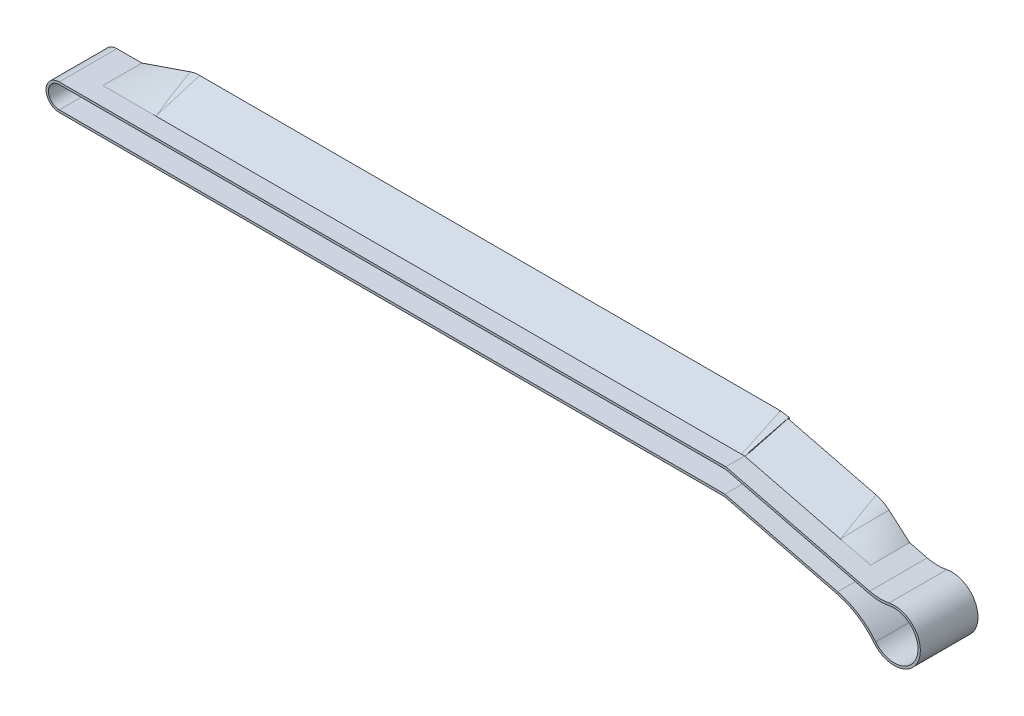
ISO-10303-21;
HEADER;
FILE_DESCRIPTION(('STEP AP214'),'2;1');
FILE_NAME('part.step','',(''),(''),'','','');
FILE_SCHEMA(('AUTOMOTIVE_DESIGN { 1 0 10303 214 1 1 1 1 }'));
ENDSEC;
DATA;
#1=APPLICATION_CONTEXT('core data for automotive mechanical design processes');
#2=APPLICATION_PROTOCOL_DEFINITION('international standard','automotive_design',2000,#1);
#3=PRODUCT_CONTEXT('',#1,'mechanical');
#4=PRODUCT('Part','Part','',(#3));
#5=PRODUCT_RELATED_PRODUCT_CATEGORY('part','',(#4));
#6=PRODUCT_DEFINITION_FORMATION('','',#4);
#7=PRODUCT_DEFINITION_CONTEXT('part definition',#1,'design');
#8=PRODUCT_DEFINITION('design','',#6,#7);
#9=PRODUCT_DEFINITION_SHAPE('','',#8);
#10=(LENGTH_UNIT() NAMED_UNIT(*) SI_UNIT(.MILLI.,.METRE.));
#11=(NAMED_UNIT(*) PLANE_ANGLE_UNIT() SI_UNIT($,.RADIAN.));
#12=(NAMED_UNIT(*) SI_UNIT($,.STERADIAN.) SOLID_ANGLE_UNIT());
#13=UNCERTAINTY_MEASURE_WITH_UNIT(LENGTH_MEASURE(1.E-05),#10,'distance_accuracy_value','');
#14=(GEOMETRIC_REPRESENTATION_CONTEXT(3) GLOBAL_UNCERTAINTY_ASSIGNED_CONTEXT((#13)) GLOBAL_UNIT_ASSIGNED_CONTEXT((#10,
#11,#12)) REPRESENTATION_CONTEXT('',''));
#15=CARTESIAN_POINT('',(0.,0.,0.));
#16=DIRECTION('',(0.,0.,1.));
#17=DIRECTION('',(1.,0.,0.));
#18=AXIS2_PLACEMENT_3D('',#15,#16,#17);
#19=CARTESIAN_POINT('',(0.,0.,120.));
#20=DIRECTION('',(0.,0.,1.));
#21=DIRECTION('',(1.,0.,0.));
#22=AXIS2_PLACEMENT_3D('',#19,#20,#21);
#23=PLANE('',#22);
#24=CARTESIAN_POINT('',(0.,0.,120.));
#25=DIRECTION('',(0.,0.,1.));
#26=DIRECTION('',(1.,0.,0.));
#27=AXIS2_PLACEMENT_3D('',#24,#25,#26);
#28=CIRCLE('',#27,85.);
#29=CARTESIAN_POINT('',(0.,85.,120.));
#30=VERTEX_POINT('',#29);
#31=CARTESIAN_POINT('',(0.,-85.,120.));
#32=VERTEX_POINT('',#31);
#33=EDGE_CURVE('E651',#30,#32,#28,.T.);
#34=ORIENTED_EDGE('',*,*,#33,.T.);
#35=DIRECTION('',(1.,0.,0.));
#36=VECTOR('',#35,1.);
#37=CARTESIAN_POINT('',(0.,-85.,120.));
#38=LINE('',#37,#36);
#39=CARTESIAN_POINT('',(4268.15823158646,-85.,120.));
#40=VERTEX_POINT('',#39);
#41=EDGE_CURVE('E654',#32,#40,#38,.T.);
#42=ORIENTED_EDGE('',*,*,#41,.T.);
#43=DIRECTION('',(0.970295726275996,-0.241921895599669,0.));
#44=VECTOR('',#43,1.);
#45=CARTESIAN_POINT('',(4268.15823158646,-85.,120.));
#46=LINE('',#45,#44);
#47=CARTESIAN_POINT('',(4990.8805144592,-265.194903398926,120.));
#48=VERTEX_POINT('',#47);
#49=EDGE_CURVE('E656',#40,#48,#46,.T.);
#50=ORIENTED_EDGE('',*,*,#49,.T.);
#51=CARTESIAN_POINT('',(4885.64448987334,-687.273544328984,120.));
#52=DIRECTION('',(0.,0.,-1.));
#53=DIRECTION('',(-1.,0.,0.));
#54=AXIS2_PLACEMENT_3D('',#51,#52,#53);
#55=CIRCLE('',#54,435.);
#56=CARTESIAN_POINT('',(5225.9592565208,-416.32915962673,120.));
#57=VERTEX_POINT('',#56);
#58=EDGE_CURVE('E658',#48,#57,#55,.T.);
#59=ORIENTED_EDGE('',*,*,#58,.T.);
#60=CARTESIAN_POINT('',(5357.,-312.,120.));
#61=DIRECTION('',(0.,0.,1.));
#62=DIRECTION('',(1.,0.,0.));
#63=AXIS2_PLACEMENT_3D('',#60,#61,#62);
#64=CIRCLE('',#63,167.5);
#65=CARTESIAN_POINT('',(5324.00606205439,-147.78169998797,120.));
#66=VERTEX_POINT('',#65);
#67=EDGE_CURVE('E660',#57,#66,#64,.T.);
#68=ORIENTED_EDGE('',*,*,#67,.T.);
#69=CARTESIAN_POINT('',(5267.86712286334,131.634511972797,120.));
#70=DIRECTION('',(0.,0.,-1.));
#71=DIRECTION('',(1.,0.,0.));
#72=AXIS2_PLACEMENT_3D('',#69,#70,#71);
#73=CIRCLE('',#72,285.);
#74=CARTESIAN_POINT('',(5198.91938261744,-144.899770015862,120.));
#75=VERTEX_POINT('',#74);
#76=EDGE_CURVE('E662',#66,#75,#73,.T.);
#77=ORIENTED_EDGE('',*,*,#76,.T.);
#78=DIRECTION('',(-0.970295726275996,0.241921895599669,0.));
#79=VECTOR('',#78,1.);
#80=CARTESIAN_POINT('',(4276.84176841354,85.,120.));
#81=LINE('',#80,#79);
#82=CARTESIAN_POINT('',(4276.84176841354,85.,120.));
#83=VERTEX_POINT('',#82);
#84=EDGE_CURVE('E455',#75,#83,#81,.T.);
#85=ORIENTED_EDGE('',*,*,#84,.T.);
#86=DIRECTION('',(-1.,0.,0.));
#87=VECTOR('',#86,1.);
#88=CARTESIAN_POINT('',(0.,85.,120.));
#89=LINE('',#88,#87);
#90=EDGE_CURVE('E448',#83,#30,#89,.T.);
#91=ORIENTED_EDGE('',*,*,#90,.T.);
#92=EDGE_LOOP('',(#34,#42,#50,#59,#68,#77,#85,#91));
#93=FACE_BOUND('',#92,.T.);
#94=DIRECTION('',(1.,0.,0.));
#95=VECTOR('',#94,1.);
#96=CARTESIAN_POINT('',(0.,-70.,120.));
#97=LINE('',#96,#95);
#98=CARTESIAN_POINT('',(0.,-70.,120.));
#99=VERTEX_POINT('',#98);
#100=CARTESIAN_POINT('',(4270.,-70.,120.));
#101=VERTEX_POINT('',#100);
#102=EDGE_CURVE('E622',#99,#101,#97,.T.);
#103=ORIENTED_EDGE('',*,*,#102,.F.);
#104=CARTESIAN_POINT('',(0.,0.,120.));
#105=DIRECTION('',(0.,0.,1.));
#106=DIRECTION('',(1.,0.,0.));
#107=AXIS2_PLACEMENT_3D('',#104,#105,#106);
#108=CIRCLE('',#107,70.);
#109=CARTESIAN_POINT('',(0.,70.,120.));
#110=VERTEX_POINT('',#109);
#111=EDGE_CURVE('E620',#110,#99,#108,.T.);
#112=ORIENTED_EDGE('',*,*,#111,.F.);
#113=DIRECTION('',(-1.,0.,0.));
#114=VECTOR('',#113,1.);
#115=CARTESIAN_POINT('',(0.,70.,120.));
#116=LINE('',#115,#114);
#117=CARTESIAN_POINT('',(4275.,70.,120.));
#118=VERTEX_POINT('',#117);
#119=EDGE_CURVE('E636',#118,#110,#116,.T.);
#120=ORIENTED_EDGE('',*,*,#119,.F.);
#121=DIRECTION('',(-0.970295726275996,0.241921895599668,0.));
#122=VECTOR('',#121,1.);
#123=CARTESIAN_POINT('',(4275.,70.,120.));
#124=LINE('',#123,#122);
#125=CARTESIAN_POINT('',(5195.29055418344,-159.454205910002,120.));
#126=VERTEX_POINT('',#125);
#127=EDGE_CURVE('E633',#126,#118,#124,.T.);
#128=ORIENTED_EDGE('',*,*,#127,.F.);
#129=CARTESIAN_POINT('',(5267.86712286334,131.634511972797,120.));
#130=DIRECTION('',(0.,0.,-1.));
#131=DIRECTION('',(1.,0.,0.));
#132=AXIS2_PLACEMENT_3D('',#129,#130,#131);
#133=CIRCLE('',#132,300.);
#134=CARTESIAN_POINT('',(5326.96074306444,-162.487816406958,120.));
#135=VERTEX_POINT('',#134);
#136=EDGE_CURVE('E631',#135,#126,#133,.T.);
#137=ORIENTED_EDGE('',*,*,#136,.F.);
#138=CARTESIAN_POINT('',(5357.,-312.,120.));
#139=DIRECTION('',(0.,0.,1.));
#140=DIRECTION('',(1.,0.,0.));
#141=AXIS2_PLACEMENT_3D('',#138,#139,#140);
#142=CIRCLE('',#141,152.5);
#143=CARTESIAN_POINT('',(5237.69424847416,-406.986249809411,120.));
#144=VERTEX_POINT('',#143);
#145=EDGE_CURVE('E629',#144,#135,#142,.T.);
#146=ORIENTED_EDGE('',*,*,#145,.F.);
#147=CARTESIAN_POINT('',(4885.64448987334,-687.273544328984,120.));
#148=DIRECTION('',(0.,0.,-1.));
#149=DIRECTION('',(-1.,0.,0.));
#150=AXIS2_PLACEMENT_3D('',#147,#148,#149);
#151=CIRCLE('',#150,450.);
#152=CARTESIAN_POINT('',(4994.50934289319,-250.640467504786,120.));
#153=VERTEX_POINT('',#152);
#154=EDGE_CURVE('E627',#153,#144,#151,.T.);
#155=ORIENTED_EDGE('',*,*,#154,.F.);
#156=DIRECTION('',(0.970295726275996,-0.241921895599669,0.));
#157=VECTOR('',#156,1.);
#158=CARTESIAN_POINT('',(4270.,-70.,120.));
#159=LINE('',#158,#157);
#160=EDGE_CURVE('E625',#101,#153,#159,.T.);
#161=ORIENTED_EDGE('',*,*,#160,.F.);
#162=EDGE_LOOP('',(#103,#112,#120,#128,#137,#146,#155,#161));
#163=FACE_BOUND('',#162,.T.);
#164=ADVANCED_FACE('F73',(#93,#163),#23,.T.);
#165=CARTESIAN_POINT('',(0.,0.,120.));
#166=DIRECTION('',(0.,0.,-1.));
#167=DIRECTION('',(-1.,0.,0.));
#168=AXIS2_PLACEMENT_3D('',#165,#166,#167);
#169=CYLINDRICAL_SURFACE('',#168,85.);
#170=DIRECTION('',(0.,0.,-1.));
#171=VECTOR('',#170,1.);
#172=CARTESIAN_POINT('',(0.,85.,120.));
#173=LINE('',#172,#171);
#174=CARTESIAN_POINT('',(0.,85.,-250.));
#175=VERTEX_POINT('',#174);
#176=EDGE_CURVE('E442',#30,#175,#173,.T.);
#177=ORIENTED_EDGE('',*,*,#176,.T.);
#178=CARTESIAN_POINT('',(0.,0.,-250.));
#179=DIRECTION('',(0.,0.,-1.));
#180=DIRECTION('',(-1.,0.,0.));
#181=AXIS2_PLACEMENT_3D('',#178,#179,#180);
#182=CIRCLE('',#181,85.);
#183=CARTESIAN_POINT('',(0.,-85.,-250.));
#184=VERTEX_POINT('',#183);
#185=EDGE_CURVE('E514',#175,#184,#182,.F.);
#186=ORIENTED_EDGE('',*,*,#185,.T.);
#187=DIRECTION('',(0.,0.,-1.));
#188=VECTOR('',#187,1.);
#189=CARTESIAN_POINT('',(0.,-85.,120.));
#190=LINE('',#189,#188);
#191=EDGE_CURVE('E466',#32,#184,#190,.T.);
#192=ORIENTED_EDGE('',*,*,#191,.F.);
#193=ORIENTED_EDGE('',*,*,#33,.F.);
#194=EDGE_LOOP('',(#177,#186,#192,#193));
#195=FACE_BOUND('',#194,.T.);
#196=ADVANCED_FACE('F674',(#195),#169,.T.);
#197=CARTESIAN_POINT('',(0.,-85.,120.));
#198=DIRECTION('',(0.,1.,0.));
#199=DIRECTION('',(0.,0.,1.));
#200=AXIS2_PLACEMENT_3D('',#197,#198,#199);
#201=PLANE('',#200);
#202=ORIENTED_EDGE('',*,*,#191,.T.);
#203=DIRECTION('',(1.,0.,0.));
#204=VECTOR('',#203,1.);
#205=CARTESIAN_POINT('',(-1665.5956415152,-85.,-250.));
#206=LINE('',#205,#204);
#207=CARTESIAN_POINT('',(4268.15823158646,-85.,-250.));
#208=VERTEX_POINT('',#207);
#209=EDGE_CURVE('E598',#184,#208,#206,.T.);
#210=ORIENTED_EDGE('',*,*,#209,.T.);
#211=DIRECTION('',(0.,0.,-1.));
#212=VECTOR('',#211,1.);
#213=CARTESIAN_POINT('',(4268.15823158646,-85.,120.));
#214=LINE('',#213,#212);
#215=EDGE_CURVE('E464',#40,#208,#214,.T.);
#216=ORIENTED_EDGE('',*,*,#215,.F.);
#217=ORIENTED_EDGE('',*,*,#41,.F.);
#218=EDGE_LOOP('',(#202,#210,#216,#217));
#219=FACE_BOUND('',#218,.T.);
#220=ADVANCED_FACE('F679',(#219),#201,.F.);
#221=CARTESIAN_POINT('',(4268.15823158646,-85.,120.));
#222=DIRECTION('',(0.241921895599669,0.970295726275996,0.));
#223=DIRECTION('',(-0.970295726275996,0.241921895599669,0.));
#224=AXIS2_PLACEMENT_3D('',#221,#222,#223);
#225=PLANE('',#224);
#226=ORIENTED_EDGE('',*,*,#215,.T.);
#227=DIRECTION('',(0.970295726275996,-0.241921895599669,0.));
#228=VECTOR('',#227,1.);
#229=CARTESIAN_POINT('',(-1291.96646293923,1301.29478564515,-250.));
#230=LINE('',#229,#228);
#231=CARTESIAN_POINT('',(4990.8805144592,-265.194903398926,-250.));
#232=VERTEX_POINT('',#231);
#233=EDGE_CURVE('E595',#208,#232,#230,.T.);
#234=ORIENTED_EDGE('',*,*,#233,.T.);
#235=DIRECTION('',(0.,0.,-1.));
#236=VECTOR('',#235,1.);
#237=CARTESIAN_POINT('',(4990.8805144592,-265.194903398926,120.));
#238=LINE('',#237,#236);
#239=EDGE_CURVE('E462',#48,#232,#238,.T.);
#240=ORIENTED_EDGE('',*,*,#239,.F.);
#241=ORIENTED_EDGE('',*,*,#49,.F.);
#242=EDGE_LOOP('',(#226,#234,#240,#241));
#243=FACE_BOUND('',#242,.T.);
#244=ADVANCED_FACE('F683',(#243),#225,.F.);
#245=CARTESIAN_POINT('',(4885.64448987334,-687.273544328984,120.));
#246=DIRECTION('',(0.,0.,-1.));
#247=DIRECTION('',(-1.,0.,0.));
#248=AXIS2_PLACEMENT_3D('',#245,#246,#247);
#249=CYLINDRICAL_SURFACE('',#248,435.);
#250=ORIENTED_EDGE('',*,*,#239,.T.);
#251=CARTESIAN_POINT('',(4885.64448987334,-687.273544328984,-250.));
#252=DIRECTION('',(0.,0.,-1.));
#253=DIRECTION('',(-1.,0.,0.));
#254=AXIS2_PLACEMENT_3D('',#251,#252,#253);
#255=CIRCLE('',#254,435.);
#256=CARTESIAN_POINT('',(5225.9592565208,-416.32915962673,-250.));
#257=VERTEX_POINT('',#256);
#258=EDGE_CURVE('E592',#232,#257,#255,.T.);
#259=ORIENTED_EDGE('',*,*,#258,.T.);
#260=DIRECTION('',(0.,0.,-1.));
#261=VECTOR('',#260,1.);
#262=CARTESIAN_POINT('',(5225.9592565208,-416.32915962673,120.));
#263=LINE('',#262,#261);
#264=EDGE_CURVE('E460',#57,#257,#263,.T.);
#265=ORIENTED_EDGE('',*,*,#264,.F.);
#266=ORIENTED_EDGE('',*,*,#58,.F.);
#267=EDGE_LOOP('',(#250,#259,#265,#266));
#268=FACE_BOUND('',#267,.T.);
#269=ADVANCED_FACE('F688',(#268),#249,.F.);
#270=CARTESIAN_POINT('',(5357.,-312.,120.));
#271=DIRECTION('',(0.,0.,-1.));
#272=DIRECTION('',(-1.,0.,0.));
#273=AXIS2_PLACEMENT_3D('',#270,#271,#272);
#274=CYLINDRICAL_SURFACE('',#273,167.5);
#275=ORIENTED_EDGE('',*,*,#264,.T.);
#276=CARTESIAN_POINT('',(5357.,-312.,-250.));
#277=DIRECTION('',(0.,0.,-1.));
#278=DIRECTION('',(-1.,0.,0.));
#279=AXIS2_PLACEMENT_3D('',#276,#277,#278);
#280=CIRCLE('',#279,167.5);
#281=CARTESIAN_POINT('',(5324.00606205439,-147.78169998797,-250.));
#282=VERTEX_POINT('',#281);
#283=EDGE_CURVE('E588',#257,#282,#280,.F.);
#284=ORIENTED_EDGE('',*,*,#283,.T.);
#285=DIRECTION('',(0.,0.,-1.));
#286=VECTOR('',#285,1.);
#287=CARTESIAN_POINT('',(5324.00606205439,-147.78169998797,120.));
#288=LINE('',#287,#286);
#289=EDGE_CURVE('E446',#66,#282,#288,.T.);
#290=ORIENTED_EDGE('',*,*,#289,.F.);
#291=ORIENTED_EDGE('',*,*,#67,.F.);
#292=EDGE_LOOP('',(#275,#284,#290,#291));
#293=FACE_BOUND('',#292,.T.);
#294=ADVANCED_FACE('F692',(#293),#274,.T.);
#295=CARTESIAN_POINT('',(5267.86712286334,131.634511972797,120.));
#296=DIRECTION('',(0.,0.,-1.));
#297=DIRECTION('',(-1.,0.,0.));
#298=AXIS2_PLACEMENT_3D('',#295,#296,#297);
#299=CYLINDRICAL_SURFACE('',#298,285.);
#300=ORIENTED_EDGE('',*,*,#289,.T.);
#301=CARTESIAN_POINT('',(5267.86712286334,131.634511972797,-250.));
#302=DIRECTION('',(0.,0.,-1.));
#303=DIRECTION('',(-1.,0.,0.));
#304=AXIS2_PLACEMENT_3D('',#301,#302,#303);
#305=CIRCLE('',#304,285.);
#306=CARTESIAN_POINT('',(5198.91938261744,-144.899770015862,-250.));
#307=VERTEX_POINT('',#306);
#308=EDGE_CURVE('E585',#282,#307,#305,.T.);
#309=ORIENTED_EDGE('',*,*,#308,.T.);
#310=DIRECTION('',(0.,0.,-1.));
#311=VECTOR('',#310,1.);
#312=CARTESIAN_POINT('',(5198.91938261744,-144.899770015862,120.));
#313=LINE('',#312,#311);
#314=EDGE_CURVE('E441',#75,#307,#313,.T.);
#315=ORIENTED_EDGE('',*,*,#314,.F.);
#316=ORIENTED_EDGE('',*,*,#76,.F.);
#317=EDGE_LOOP('',(#300,#309,#315,#316));
#318=FACE_BOUND('',#317,.T.);
#319=ADVANCED_FACE('F696',(#318),#299,.F.);
#320=CARTESIAN_POINT('',(4276.84176841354,85.,120.));
#321=DIRECTION('',(-0.241921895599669,-0.970295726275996,0.));
#322=DIRECTION('',(0.970295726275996,-0.241921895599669,0.));
#323=AXIS2_PLACEMENT_3D('',#320,#321,#322);
#324=PLANE('',#323);
#325=ORIENTED_EDGE('',*,*,#314,.T.);
#326=DIRECTION('',(-0.970295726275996,0.241921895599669,0.));
#327=VECTOR('',#326,1.);
#328=CARTESIAN_POINT('',(-1251.55316565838,1463.38366784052,-250.));
#329=LINE('',#328,#327);
#330=CARTESIAN_POINT('',(5086.18086951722,-116.790901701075,-250.));
#331=VERTEX_POINT('',#330);
#332=EDGE_CURVE('E589',#307,#331,#329,.T.);
#333=ORIENTED_EDGE('',*,*,#332,.T.);
#334=DIRECTION('',(0.,0.,1.));
#335=VECTOR('',#334,1.);
#336=CARTESIAN_POINT('',(5086.18086951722,-116.790901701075,-250.));
#337=LINE('',#336,#335);
#338=CARTESIAN_POINT('',(5086.18086951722,-116.790901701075,0.));
#339=VERTEX_POINT('',#338);
#340=EDGE_CURVE('E488',#331,#339,#337,.T.);
#341=ORIENTED_EDGE('',*,*,#340,.T.);
#342=DIRECTION('',(0.970295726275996,-0.241921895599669,0.));
#343=VECTOR('',#342,1.);
#344=CARTESIAN_POINT('',(4276.84176841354,85.,0.));
#345=LINE('',#344,#343);
#346=CARTESIAN_POINT('',(4892.12172426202,-68.4065225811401,0.));
#347=VERTEX_POINT('',#346);
#348=EDGE_CURVE('E969',#339,#347,#345,.F.);
#349=ORIENTED_EDGE('',*,*,#348,.T.);
#350=DIRECTION('',(0.970295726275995,-0.241921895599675,0.));
#351=VECTOR('',#350,1.);
#352=CARTESIAN_POINT('',(4280.83541670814,84.0042716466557,0.));
#353=LINE('',#352,#351);
#354=CARTESIAN_POINT('',(4280.83541670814,84.0042716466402,3.88508660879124E-11));
#355=VERTEX_POINT('',#354);
#356=EDGE_CURVE('E574',#355,#347,#353,.T.);
#357=ORIENTED_EDGE('',*,*,#356,.F.);
#358=DIRECTION('',(0.970295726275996,-0.241921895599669,0.));
#359=VECTOR('',#358,1.);
#360=CARTESIAN_POINT('',(4276.84176841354,85.,0.));
#361=LINE('',#360,#359);
#362=CARTESIAN_POINT('',(4276.84176841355,85.,0.));
#363=VERTEX_POINT('',#362);
#364=EDGE_CURVE('E650',#355,#363,#361,.F.);
#365=ORIENTED_EDGE('',*,*,#364,.T.);
#366=DIRECTION('',(0.,0.,-1.));
#367=VECTOR('',#366,1.);
#368=CARTESIAN_POINT('',(4276.84176841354,85.,120.));
#369=LINE('',#368,#367);
#370=EDGE_CURVE('E439',#83,#363,#369,.T.);
#371=ORIENTED_EDGE('',*,*,#370,.F.);
#372=ORIENTED_EDGE('',*,*,#84,.F.);
#373=EDGE_LOOP('',(#325,#333,#341,#349,#357,#365,#371,#372));
#374=FACE_BOUND('',#373,.T.);
#375=ADVANCED_FACE('F669',(#374),#324,.F.);
#376=CARTESIAN_POINT('',(0.,85.,120.));
#377=DIRECTION('',(0.,-1.,0.));
#378=DIRECTION('',(0.,0.,-1.));
#379=AXIS2_PLACEMENT_3D('',#376,#377,#378);
#380=PLANE('',#379);
#381=DIRECTION('',(1.,0.,0.));
#382=VECTOR('',#381,1.);
#383=CARTESIAN_POINT('',(0.,85.,0.));
#384=LINE('',#383,#382);
#385=CARTESIAN_POINT('',(4257.,85.,0.));
#386=VERTEX_POINT('',#385);
#387=EDGE_CURVE('E322',#363,#386,#384,.F.);
#388=ORIENTED_EDGE('',*,*,#387,.T.);
#389=DIRECTION('',(-1.,0.,0.));
#390=VECTOR('',#389,1.);
#391=CARTESIAN_POINT('',(4257.,85.,0.));
#392=LINE('',#391,#390);
#393=CARTESIAN_POINT('',(500.,85.,0.));
#394=VERTEX_POINT('',#393);
#395=EDGE_CURVE('E481',#386,#394,#392,.T.);
#396=ORIENTED_EDGE('',*,*,#395,.T.);
#397=DIRECTION('',(1.,0.,0.));
#398=VECTOR('',#397,1.);
#399=CARTESIAN_POINT('',(0.,85.,0.));
#400=LINE('',#399,#398);
#401=CARTESIAN_POINT('',(160.,85.,0.));
#402=VERTEX_POINT('',#401);
#403=EDGE_CURVE('E780',#394,#402,#400,.F.);
#404=ORIENTED_EDGE('',*,*,#403,.T.);
#405=DIRECTION('',(0.,0.,1.));
#406=VECTOR('',#405,1.);
#407=CARTESIAN_POINT('',(160.,85.,-250.));
#408=LINE('',#407,#406);
#409=CARTESIAN_POINT('',(160.,85.,-250.));
#410=VERTEX_POINT('',#409);
#411=EDGE_CURVE('E498',#410,#402,#408,.T.);
#412=ORIENTED_EDGE('',*,*,#411,.F.);
#413=DIRECTION('',(-1.,0.,0.));
#414=VECTOR('',#413,1.);
#415=CARTESIAN_POINT('',(-1665.5956415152,85.,-250.));
#416=LINE('',#415,#414);
#417=EDGE_CURVE('E506',#410,#175,#416,.T.);
#418=ORIENTED_EDGE('',*,*,#417,.T.);
#419=ORIENTED_EDGE('',*,*,#176,.F.);
#420=ORIENTED_EDGE('',*,*,#90,.F.);
#421=ORIENTED_EDGE('',*,*,#370,.T.);
#422=EDGE_LOOP('',(#388,#396,#404,#412,#418,#419,#420,#421));
#423=FACE_BOUND('',#422,.T.);
#424=ADVANCED_FACE('F670',(#423),#380,.F.);
#425=CARTESIAN_POINT('',(0.,0.,120.));
#426=DIRECTION('',(0.,0.,-1.));
#427=DIRECTION('',(-1.,0.,0.));
#428=AXIS2_PLACEMENT_3D('',#425,#426,#427);
#429=CYLINDRICAL_SURFACE('',#428,70.);
#430=DIRECTION('',(0.,0.,-1.));
#431=VECTOR('',#430,1.);
#432=CARTESIAN_POINT('',(0.,-70.,120.));
#433=LINE('',#432,#431);
#434=CARTESIAN_POINT('',(0.,-70.,-250.));
#435=VERTEX_POINT('',#434);
#436=EDGE_CURVE('E648',#99,#435,#433,.T.);
#437=ORIENTED_EDGE('',*,*,#436,.T.);
#438=CARTESIAN_POINT('',(0.,0.,-250.));
#439=DIRECTION('',(0.,0.,-1.));
#440=DIRECTION('',(-1.,0.,0.));
#441=AXIS2_PLACEMENT_3D('',#438,#439,#440);
#442=CIRCLE('',#441,70.);
#443=CARTESIAN_POINT('',(0.,70.,-250.));
#444=VERTEX_POINT('',#443);
#445=EDGE_CURVE('E505',#444,#435,#442,.F.);
#446=ORIENTED_EDGE('',*,*,#445,.F.);
#447=DIRECTION('',(0.,0.,-1.));
#448=VECTOR('',#447,1.);
#449=CARTESIAN_POINT('',(0.,70.,120.));
#450=LINE('',#449,#448);
#451=EDGE_CURVE('E431',#110,#444,#450,.T.);
#452=ORIENTED_EDGE('',*,*,#451,.F.);
#453=ORIENTED_EDGE('',*,*,#111,.T.);
#454=EDGE_LOOP('',(#437,#446,#452,#453));
#455=FACE_BOUND('',#454,.T.);
#456=ADVANCED_FACE('F926',(#455),#429,.F.);
#457=CARTESIAN_POINT('',(0.,-70.,120.));
#458=DIRECTION('',(0.,1.,0.));
#459=DIRECTION('',(0.,0.,1.));
#460=AXIS2_PLACEMENT_3D('',#457,#458,#459);
#461=PLANE('',#460);
#462=DIRECTION('',(0.,0.,-1.));
#463=VECTOR('',#462,1.);
#464=CARTESIAN_POINT('',(4270.,-70.,120.));
#465=LINE('',#464,#463);
#466=CARTESIAN_POINT('',(4270.,-70.0000000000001,-250.));
#467=VERTEX_POINT('',#466);
#468=EDGE_CURVE('E646',#101,#467,#465,.T.);
#469=ORIENTED_EDGE('',*,*,#468,.T.);
#470=DIRECTION('',(1.,0.,0.));
#471=VECTOR('',#470,1.);
#472=CARTESIAN_POINT('',(-1665.5956415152,-70.,-250.));
#473=LINE('',#472,#471);
#474=EDGE_CURVE('E604',#435,#467,#473,.T.);
#475=ORIENTED_EDGE('',*,*,#474,.F.);
#476=ORIENTED_EDGE('',*,*,#436,.F.);
#477=ORIENTED_EDGE('',*,*,#102,.T.);
#478=EDGE_LOOP('',(#469,#475,#476,#477));
#479=FACE_BOUND('',#478,.T.);
#480=ADVANCED_FACE('F931',(#479),#461,.T.);
#481=CARTESIAN_POINT('',(4270.,-70.,120.));
#482=DIRECTION('',(0.241921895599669,0.970295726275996,0.));
#483=DIRECTION('',(-0.970295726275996,0.241921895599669,0.));
#484=AXIS2_PLACEMENT_3D('',#481,#482,#483);
#485=PLANE('',#484);
#486=DIRECTION('',(0.,0.,-1.));
#487=VECTOR('',#486,1.);
#488=CARTESIAN_POINT('',(4994.50934289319,-250.640467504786,120.));
#489=LINE('',#488,#487);
#490=CARTESIAN_POINT('',(4994.50934289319,-250.640467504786,-250.));
#491=VERTEX_POINT('',#490);
#492=EDGE_CURVE('E644',#153,#491,#489,.T.);
#493=ORIENTED_EDGE('',*,*,#492,.T.);
#494=DIRECTION('',(0.970295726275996,-0.241921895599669,0.));
#495=VECTOR('',#494,1.);
#496=CARTESIAN_POINT('',(-1288.33763450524,1315.84922153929,-250.));
#497=LINE('',#496,#495);
#498=EDGE_CURVE('E607',#467,#491,#497,.T.);
#499=ORIENTED_EDGE('',*,*,#498,.F.);
#500=ORIENTED_EDGE('',*,*,#468,.F.);
#501=ORIENTED_EDGE('',*,*,#160,.T.);
#502=EDGE_LOOP('',(#493,#499,#500,#501));
#503=FACE_BOUND('',#502,.T.);
#504=ADVANCED_FACE('F939',(#503),#485,.T.);
#505=CARTESIAN_POINT('',(4885.64448987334,-687.273544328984,120.));
#506=DIRECTION('',(0.,0.,-1.));
#507=DIRECTION('',(-1.,0.,0.));
#508=AXIS2_PLACEMENT_3D('',#505,#506,#507);
#509=CYLINDRICAL_SURFACE('',#508,450.);
#510=DIRECTION('',(0.,0.,-1.));
#511=VECTOR('',#510,1.);
#512=CARTESIAN_POINT('',(5237.69424847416,-406.986249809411,120.));
#513=LINE('',#512,#511);
#514=CARTESIAN_POINT('',(5237.69424847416,-406.986249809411,-250.));
#515=VERTEX_POINT('',#514);
#516=EDGE_CURVE('E642',#144,#515,#513,.T.);
#517=ORIENTED_EDGE('',*,*,#516,.T.);
#518=CARTESIAN_POINT('',(4885.64448987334,-687.273544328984,-250.));
#519=DIRECTION('',(0.,0.,-1.));
#520=DIRECTION('',(-1.,0.,0.));
#521=AXIS2_PLACEMENT_3D('',#518,#519,#520);
#522=CIRCLE('',#521,450.);
#523=EDGE_CURVE('E610',#491,#515,#522,.T.);
#524=ORIENTED_EDGE('',*,*,#523,.F.);
#525=ORIENTED_EDGE('',*,*,#492,.F.);
#526=ORIENTED_EDGE('',*,*,#154,.T.);
#527=EDGE_LOOP('',(#517,#524,#525,#526));
#528=FACE_BOUND('',#527,.T.);
#529=ADVANCED_FACE('F943',(#528),#509,.T.);
#530=CARTESIAN_POINT('',(5357.,-312.,120.));
#531=DIRECTION('',(0.,0.,-1.));
#532=DIRECTION('',(-1.,0.,0.));
#533=AXIS2_PLACEMENT_3D('',#530,#531,#532);
#534=CYLINDRICAL_SURFACE('',#533,152.5);
#535=DIRECTION('',(0.,0.,-1.));
#536=VECTOR('',#535,1.);
#537=CARTESIAN_POINT('',(5326.96074306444,-162.487816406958,120.));
#538=LINE('',#537,#536);
#539=CARTESIAN_POINT('',(5326.96074306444,-162.487816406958,-250.));
#540=VERTEX_POINT('',#539);
#541=EDGE_CURVE('E640',#135,#540,#538,.T.);
#542=ORIENTED_EDGE('',*,*,#541,.T.);
#543=CARTESIAN_POINT('',(5357.,-312.,-250.));
#544=DIRECTION('',(0.,0.,-1.));
#545=DIRECTION('',(-1.,0.,0.));
#546=AXIS2_PLACEMENT_3D('',#543,#544,#545);
#547=CIRCLE('',#546,152.5);
#548=EDGE_CURVE('E613',#515,#540,#547,.F.);
#549=ORIENTED_EDGE('',*,*,#548,.F.);
#550=ORIENTED_EDGE('',*,*,#516,.F.);
#551=ORIENTED_EDGE('',*,*,#145,.T.);
#552=EDGE_LOOP('',(#542,#549,#550,#551));
#553=FACE_BOUND('',#552,.T.);
#554=ADVANCED_FACE('F948',(#553),#534,.F.);
#555=CARTESIAN_POINT('',(5267.86712286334,131.634511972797,120.));
#556=DIRECTION('',(0.,0.,-1.));
#557=DIRECTION('',(-1.,0.,0.));
#558=AXIS2_PLACEMENT_3D('',#555,#556,#557);
#559=CYLINDRICAL_SURFACE('',#558,300.);
#560=DIRECTION('',(0.,0.,-1.));
#561=VECTOR('',#560,1.);
#562=CARTESIAN_POINT('',(5195.29055418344,-159.454205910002,120.));
#563=LINE('',#562,#561);
#564=CARTESIAN_POINT('',(5195.29055418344,-159.454205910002,-250.));
#565=VERTEX_POINT('',#564);
#566=EDGE_CURVE('E430',#126,#565,#563,.T.);
#567=ORIENTED_EDGE('',*,*,#566,.T.);
#568=CARTESIAN_POINT('',(5267.86712286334,131.634511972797,-250.));
#569=DIRECTION('',(0.,0.,-1.));
#570=DIRECTION('',(-1.,0.,0.));
#571=AXIS2_PLACEMENT_3D('',#568,#569,#570);
#572=CIRCLE('',#571,300.);
#573=EDGE_CURVE('E616',#540,#565,#572,.T.);
#574=ORIENTED_EDGE('',*,*,#573,.F.);
#575=ORIENTED_EDGE('',*,*,#541,.F.);
#576=ORIENTED_EDGE('',*,*,#136,.T.);
#577=EDGE_LOOP('',(#567,#574,#575,#576));
#578=FACE_BOUND('',#577,.T.);
#579=ADVANCED_FACE('F952',(#578),#559,.T.);
#580=CARTESIAN_POINT('',(4275.,70.,120.));
#581=DIRECTION('',(-0.241921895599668,-0.970295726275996,0.));
#582=DIRECTION('',(0.970295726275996,-0.241921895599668,0.));
#583=AXIS2_PLACEMENT_3D('',#580,#581,#582);
#584=PLANE('',#583);
#585=DIRECTION('',(0.970295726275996,-0.241921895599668,0.));
#586=VECTOR('',#585,1.);
#587=CARTESIAN_POINT('',(4275.,70.,0.));
#588=LINE('',#587,#586);
#589=CARTESIAN_POINT('',(5082.55204108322,-131.345337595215,0.));
#590=VERTEX_POINT('',#589);
#591=CARTESIAN_POINT('',(4888.49289582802,-82.9609584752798,0.));
#592=VERTEX_POINT('',#591);
#593=EDGE_CURVE('E801',#590,#592,#588,.F.);
#594=ORIENTED_EDGE('',*,*,#593,.F.);
#595=DIRECTION('',(0.,0.,1.));
#596=VECTOR('',#595,1.);
#597=CARTESIAN_POINT('',(5082.55204108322,-131.345337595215,-250.));
#598=LINE('',#597,#596);
#599=CARTESIAN_POINT('',(5082.55204108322,-131.345337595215,-250.));
#600=VERTEX_POINT('',#599);
#601=EDGE_CURVE('E499',#600,#590,#598,.T.);
#602=ORIENTED_EDGE('',*,*,#601,.F.);
#603=DIRECTION('',(-0.970295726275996,0.241921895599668,0.));
#604=VECTOR('',#603,1.);
#605=CARTESIAN_POINT('',(-1255.18199409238,1448.82923194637,-250.));
#606=LINE('',#605,#604);
#607=EDGE_CURVE('E619',#565,#600,#606,.T.);
#608=ORIENTED_EDGE('',*,*,#607,.F.);
#609=ORIENTED_EDGE('',*,*,#566,.F.);
#610=ORIENTED_EDGE('',*,*,#127,.T.);
#611=DIRECTION('',(0.,0.,-1.));
#612=VECTOR('',#611,1.);
#613=CARTESIAN_POINT('',(4275.,70.,120.));
#614=LINE('',#613,#612);
#615=CARTESIAN_POINT('',(4274.99999999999,70.000000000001,0.));
#616=VERTEX_POINT('',#615);
#617=EDGE_CURVE('E428',#118,#616,#614,.T.);
#618=ORIENTED_EDGE('',*,*,#617,.T.);
#619=DIRECTION('',(0.970295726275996,-0.241921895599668,0.));
#620=VECTOR('',#619,1.);
#621=CARTESIAN_POINT('',(4275.,70.,0.));
#622=LINE('',#621,#620);
#623=CARTESIAN_POINT('',(4277.20658827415,69.4498357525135,-1.08940634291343E-12));
#624=VERTEX_POINT('',#623);
#625=EDGE_CURVE('E478',#624,#616,#622,.F.);
#626=ORIENTED_EDGE('',*,*,#625,.F.);
#627=DIRECTION('',(0.970295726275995,-0.241921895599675,0.));
#628=VECTOR('',#627,1.);
#629=CARTESIAN_POINT('',(4277.20658827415,69.4498357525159,0.));
#630=LINE('',#629,#628);
#631=EDGE_CURVE('E435',#624,#592,#630,.T.);
#632=ORIENTED_EDGE('',*,*,#631,.T.);
#633=EDGE_LOOP('',(#594,#602,#608,#609,#610,#618,#626,#632));
#634=FACE_BOUND('',#633,.T.);
#635=ADVANCED_FACE('F956',(#634),#584,.T.);
#636=CARTESIAN_POINT('',(0.,70.,120.));
#637=DIRECTION('',(0.,-1.,0.));
#638=DIRECTION('',(0.,0.,-1.));
#639=AXIS2_PLACEMENT_3D('',#636,#637,#638);
#640=PLANE('',#639);
#641=DIRECTION('',(1.,0.,0.));
#642=VECTOR('',#641,1.);
#643=CARTESIAN_POINT('',(0.,70.,0.));
#644=LINE('',#643,#642);
#645=CARTESIAN_POINT('',(4257.,70.,0.));
#646=VERTEX_POINT('',#645);
#647=EDGE_CURVE('E623',#616,#646,#644,.F.);
#648=ORIENTED_EDGE('',*,*,#647,.F.);
#649=ORIENTED_EDGE('',*,*,#617,.F.);
#650=ORIENTED_EDGE('',*,*,#119,.T.);
#651=ORIENTED_EDGE('',*,*,#451,.T.);
#652=DIRECTION('',(-1.,0.,0.));
#653=VECTOR('',#652,1.);
#654=CARTESIAN_POINT('',(-1665.5956415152,70.,-250.));
#655=LINE('',#654,#653);
#656=CARTESIAN_POINT('',(160.,70.,-250.));
#657=VERTEX_POINT('',#656);
#658=EDGE_CURVE('E502',#657,#444,#655,.T.);
#659=ORIENTED_EDGE('',*,*,#658,.F.);
#660=DIRECTION('',(0.,0.,1.));
#661=VECTOR('',#660,1.);
#662=CARTESIAN_POINT('',(160.,70.,-250.));
#663=LINE('',#662,#661);
#664=CARTESIAN_POINT('',(160.,70.,0.));
#665=VERTEX_POINT('',#664);
#666=EDGE_CURVE('E495',#657,#665,#663,.T.);
#667=ORIENTED_EDGE('',*,*,#666,.T.);
#668=DIRECTION('',(1.,0.,0.));
#669=VECTOR('',#668,1.);
#670=CARTESIAN_POINT('',(0.,70.,0.));
#671=LINE('',#670,#669);
#672=CARTESIAN_POINT('',(500.,69.9999999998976,2.17145745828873E-10));
#673=VERTEX_POINT('',#672);
#674=EDGE_CURVE('E797',#673,#665,#671,.F.);
#675=ORIENTED_EDGE('',*,*,#674,.F.);
#676=DIRECTION('',(-1.,0.,0.));
#677=VECTOR('',#676,1.);
#678=CARTESIAN_POINT('',(4257.,70.,0.));
#679=LINE('',#678,#677);
#680=EDGE_CURVE('E475',#646,#673,#679,.T.);
#681=ORIENTED_EDGE('',*,*,#680,.F.);
#682=EDGE_LOOP('',(#648,#649,#650,#651,#659,#667,#675,#681));
#683=FACE_BOUND('',#682,.T.);
#684=ADVANCED_FACE('F795',(#683),#640,.T.);
#685=CARTESIAN_POINT('',(4257.,189.256007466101,-255.745333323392));
#686=DIRECTION('',(0.,0.906307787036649,0.422618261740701));
#687=DIRECTION('',(0.,-0.422618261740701,0.906307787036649));
#688=AXIS2_PLACEMENT_3D('',#685,#686,#687);
#689=PLANE('',#688);
#690=DIRECTION('',(0.,0.422618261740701,-0.906307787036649));
#691=VECTOR('',#690,1.);
#692=CARTESIAN_POINT('',(500.,189.256007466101,-255.745333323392));
#693=LINE('',#692,#691);
#694=CARTESIAN_POINT('',(500.,189.256007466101,-255.745333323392));
#695=VERTEX_POINT('',#694);
#696=EDGE_CURVE('E486',#673,#695,#693,.T.);
#697=ORIENTED_EDGE('',*,*,#696,.T.);
#698=DIRECTION('',(-1.,0.,0.));
#699=VECTOR('',#698,1.);
#700=CARTESIAN_POINT('',(4257.,189.256007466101,-255.745333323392));
#701=LINE('',#700,#699);
#702=CARTESIAN_POINT('',(4257.,189.256007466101,-255.745333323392));
#703=VERTEX_POINT('',#702);
#704=EDGE_CURVE('E479',#703,#695,#701,.T.);
#705=ORIENTED_EDGE('',*,*,#704,.F.);
#706=DIRECTION('',(0.,0.422618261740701,-0.906307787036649));
#707=VECTOR('',#706,1.);
#708=CARTESIAN_POINT('',(4257.,189.256007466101,-255.745333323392));
#709=LINE('',#708,#707);
#710=EDGE_CURVE('E469',#646,#703,#709,.T.);
#711=ORIENTED_EDGE('',*,*,#710,.F.);
#712=ORIENTED_EDGE('',*,*,#680,.T.);
#713=EDGE_LOOP('',(#697,#705,#711,#712));
#714=FACE_BOUND('',#713,.T.);
#715=ADVANCED_FACE('F790',(#714),#689,.F.);
#716=CARTESIAN_POINT('',(4257.,201.57691453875,-250.));
#717=DIRECTION('',(0.,-0.422618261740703,0.906307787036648));
#718=DIRECTION('',(0.,-0.906307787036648,-0.422618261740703));
#719=AXIS2_PLACEMENT_3D('',#716,#717,#718);
#720=PLANE('',#719);
#721=DIRECTION('',(0.,0.906307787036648,0.422618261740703));
#722=VECTOR('',#721,1.);
#723=CARTESIAN_POINT('',(500.,201.57691453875,-250.));
#724=LINE('',#723,#722);
#725=CARTESIAN_POINT('',(500.,199.386279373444,-251.021509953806));
#726=VERTEX_POINT('',#725);
#727=EDGE_CURVE('E472',#695,#726,#724,.T.);
#728=ORIENTED_EDGE('',*,*,#727,.T.);
#729=CARTESIAN_POINT('',(499.999999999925,85.000000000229,-4.91259810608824E-10));
#730=CARTESIAN_POINT('',(499.999999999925,85.0000000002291,-4.91232055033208E-10));
#731=CARTESIAN_POINT('',(500.,85.,0.));
#732=CARTESIAN_POINT('',(500.007883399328,85.0291942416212,-0.0626072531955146));
#733=CARTESIAN_POINT('',(499.999895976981,85.0295794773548,-0.0634333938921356));
#734=CARTESIAN_POINT('',(499.991908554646,85.0299647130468,-0.0642595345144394));
#735=CARTESIAN_POINT('',(500.015766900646,85.0583884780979,-0.125214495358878));
#736=CARTESIAN_POINT('',(499.999791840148,85.0591589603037,-0.12686679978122));
#737=CARTESIAN_POINT('',(499.983816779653,85.0599276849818,-0.128519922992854));
#738=CARTESIAN_POINT('',(500.025524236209,85.0945214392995,-0.20270188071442));
#739=CARTESIAN_POINT('',(499.999662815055,85.0957687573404,-0.205376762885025));
#740=CARTESIAN_POINT('',(499.973801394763,85.0970099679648,-0.208054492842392));
#741=CARTESIAN_POINT('',(500.027397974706,85.1014601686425,-0.21758203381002));
#742=CARTESIAN_POINT('',(499.999638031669,85.1027990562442,-0.220453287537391));
#743=CARTESIAN_POINT('',(499.9718780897,85.1041309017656,-0.223327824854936));
#744=CARTESIAN_POINT('',(500.036766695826,85.1361538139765,-0.291982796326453));
#745=CARTESIAN_POINT('',(499.999514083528,85.1379505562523,-0.295835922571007));
#746=CARTESIAN_POINT('',(499.962261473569,85.139735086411,-0.299694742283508));
#747=CARTESIAN_POINT('',(500.04426176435,85.1639087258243,-0.351503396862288));
#748=CARTESIAN_POINT('',(499.999414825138,85.1660717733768,-0.35614206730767));
#749=CARTESIAN_POINT('',(499.954567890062,85.1682168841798,-0.360789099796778));
#750=CARTESIAN_POINT('',(500.081737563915,85.3026832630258,-0.649106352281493));
#751=CARTESIAN_POINT('',(499.998918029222,85.3066779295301,-0.657672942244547));
#752=CARTESIAN_POINT('',(499.916098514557,85.3106180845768,-0.666264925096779));
#753=CARTESIAN_POINT('',(500.11171966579,85.4137028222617,-0.887188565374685));
#754=CARTESIAN_POINT('',(499.998518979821,85.4191630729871,-0.898898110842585));
#755=CARTESIAN_POINT('',(499.885318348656,85.4245141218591,-0.910658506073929));
#756=CARTESIAN_POINT('',(500.261637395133,85.9688002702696,-2.07759888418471));
#757=CARTESIAN_POINT('',(499.99651568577,85.981590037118,-2.10502662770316));
#758=CARTESIAN_POINT('',(499.731394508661,85.993869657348,-2.13269115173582));
#759=CARTESIAN_POINT('',(500.381594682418,86.4128771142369,-3.02992474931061));
#760=CARTESIAN_POINT('',(499.994887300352,86.4315354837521,-3.06993775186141));
#761=CARTESIAN_POINT('',(499.60818180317,86.4489552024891,-3.11052443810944));
#762=CARTESIAN_POINT('',(500.981490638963,88.6332560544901,-7.79154275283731));
#763=CARTESIAN_POINT('',(499.98661682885,88.6812874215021,-7.8945463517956));
#764=CARTESIAN_POINT('',(498.991768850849,88.7223810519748,-8.00072293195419));
#765=CARTESIAN_POINT('',(501.461757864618,90.4095422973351,-11.6008008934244));
#766=CARTESIAN_POINT('',(499.979589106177,90.4811662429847,-11.7543989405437));
#767=CARTESIAN_POINT('',(498.49752033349,90.5347157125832,-11.9161842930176));
#768=CARTESIAN_POINT('',(502.903382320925,95.7383613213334,-23.0284901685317));
#769=CARTESIAN_POINT('',(499.957286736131,95.8809622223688,-23.3342987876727));
#770=CARTESIAN_POINT('',(497.012155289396,95.9522268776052,-23.6723343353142));
#771=CARTESIAN_POINT('',(503.86556231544,99.2908543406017,-30.6468360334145));
#772=CARTESIAN_POINT('',(499.94079207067,99.4811682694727,-31.0549655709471));
#773=CARTESIAN_POINT('',(496.018419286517,99.5379105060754,-31.5227888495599));
#774=CARTESIAN_POINT('',(505.790849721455,106.395795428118,-45.883431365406));
#775=CARTESIAN_POINT('',(499.904672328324,106.681192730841,-46.4954678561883));
#776=CARTESIAN_POINT('',(494.028058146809,106.656197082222,-47.248746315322));
#777=CARTESIAN_POINT('',(506.753957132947,109.948243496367,-53.5016808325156));
#778=CARTESIAN_POINT('',(499.885043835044,110.281540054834,-54.2164376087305));
#779=CARTESIAN_POINT('',(493.031433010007,110.188800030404,-55.1242492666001));
#780=CARTESIAN_POINT('',(509.033291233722,118.357222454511,-71.5347944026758));
#781=CARTESIAN_POINT('',(499.83509156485,118.803782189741,-72.4924448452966));
#782=CARTESIAN_POINT('',(490.673977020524,118.487156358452,-73.7944259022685));
#783=CARTESIAN_POINT('',(510.349361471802,123.213760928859,-81.9496747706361));
#784=CARTESIAN_POINT('',(499.803482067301,123.725979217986,-83.0481304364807));
#785=CARTESIAN_POINT('',(489.313749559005,123.229553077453,-84.5994388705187));
#786=CARTESIAN_POINT('',(512.977474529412,132.927033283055,-102.779854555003));
#787=CARTESIAN_POINT('',(499.735385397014,133.568357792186,-104.155179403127));
#788=CARTESIAN_POINT('',(486.607055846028,132.613655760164,-106.250006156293));
#789=CARTESIAN_POINT('',(514.289517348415,137.783767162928,-113.195153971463));
#790=CARTESIAN_POINT('',(499.69888497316,138.489881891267,-114.709421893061));
#791=CARTESIAN_POINT('',(485.260589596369,137.255361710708,-117.095560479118));
#792=CARTESIAN_POINT('',(517.254558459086,148.790701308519,-136.799600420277));
#793=CARTESIAN_POINT('',(499.611525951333,149.641966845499,-138.625145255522));
#794=CARTESIAN_POINT('',(482.237401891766,147.662219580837,-141.714866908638));
#795=CARTESIAN_POINT('',(518.905329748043,154.94100884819,-149.988977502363));
#796=CARTESIAN_POINT('',(499.559421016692,155.872534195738,-151.98664005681));
#797=CARTESIAN_POINT('',(480.568196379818,153.397454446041,-155.49944507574));
#798=CARTESIAN_POINT('',(522.188390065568,167.242504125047,-176.369619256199));
#799=CARTESIAN_POINT('',(499.450551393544,168.328103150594,-178.697693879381));
#800=CARTESIAN_POINT('',(477.2912603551,164.71608173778,-183.115495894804));
#801=CARTESIAN_POINT('',(523.82067910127,173.393691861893,-189.560883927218));
#802=CARTESIAN_POINT('',(499.393756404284,174.555607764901,-192.052620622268));
#803=CARTESIAN_POINT('',(475.683529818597,170.299474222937,-196.946968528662));
#804=CARTESIAN_POINT('',(526.204044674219,182.444654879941,-208.970736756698));
#805=CARTESIAN_POINT('',(499.308313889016,183.708143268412,-211.680296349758));
#806=CARTESIAN_POINT('',(473.377323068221,178.410959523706,-217.323074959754));
#807=CARTESIAN_POINT('',(526.964736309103,185.343978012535,-215.188355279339));
#808=CARTESIAN_POINT('',(499.280633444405,186.641241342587,-217.970345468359));
#809=CARTESIAN_POINT('',(472.647540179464,180.993636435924,-223.853875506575));
#810=CARTESIAN_POINT('',(528.48002893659,191.142909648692,-227.62420430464));
#811=CARTESIAN_POINT('',(499.224897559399,192.506288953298,-230.547980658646));
#812=CARTESIAN_POINT('',(471.207530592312,186.129346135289,-236.922195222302));
#813=CARTESIAN_POINT('',(529.234629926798,194.042518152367,-233.842434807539));
#814=CARTESIAN_POINT('',(499.196839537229,195.438465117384,-236.836052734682));
#815=CARTESIAN_POINT('',(470.497303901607,188.682378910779,-243.459714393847));
#816=CARTESIAN_POINT('',(529.985885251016,196.942281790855,-240.060997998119));
#817=CARTESIAN_POINT('',(499.168717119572,198.368272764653,-243.119045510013));
#818=CARTESIAN_POINT('',(469.797695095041,191.221351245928,-249.999999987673));
#819=CARTESIAN_POINT('',(530.407302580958,198.568893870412,-243.549278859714));
#820=CARTESIAN_POINT('',(499.152926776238,200.01326702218,-246.646747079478));
#821=CARTESIAN_POINT('',(469.405235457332,192.645589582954,-253.66875295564));
#822=CARTESIAN_POINT('',(530.827668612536,200.195554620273,-247.037664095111));
#823=CARTESIAN_POINT('',(499.137114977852,201.657573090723,-250.172972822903));
#824=CARTESIAN_POINT('',(469.016106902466,194.065410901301,-257.338377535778));
#825=CARTESIAN_POINT('',(531.666203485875,203.448976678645,-254.014650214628));
#826=CARTESIAN_POINT('',(499.105473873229,204.945824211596,-257.22465010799));
#827=CARTESIAN_POINT('',(468.244746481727,196.896527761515,-264.679169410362));
#828=CARTESIAN_POINT('',(532.084372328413,205.07573798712,-257.503251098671));
#829=CARTESIAN_POINT('',(499.089644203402,206.589805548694,-260.750179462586));
#830=CARTESIAN_POINT('',(467.862514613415,198.3078233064,-268.350336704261));
#831=CARTESIAN_POINT('',(532.91841856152,208.329365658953,-264.480678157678));
#832=CARTESIAN_POINT('',(499.058002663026,209.877397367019,-267.800442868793));
#833=CARTESIAN_POINT('',(467.105181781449,201.122197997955,-275.694016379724));
#834=CARTESIAN_POINT('',(533.33429595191,209.956232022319,-267.96950433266));
#835=CARTESIAN_POINT('',(499.042190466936,211.521042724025,-271.325251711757));
#836=CARTESIAN_POINT('',(466.730080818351,202.525277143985,-279.366528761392));
#837=CARTESIAN_POINT('',(534.163669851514,213.210073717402,-274.947390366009));
#838=CARTESIAN_POINT('',(499.010616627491,214.807958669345,-278.374065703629));
#839=CARTESIAN_POINT('',(465.987213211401,205.323541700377,-286.712707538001));
#840=CARTESIAN_POINT('',(534.577166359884,214.837049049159,-278.436450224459));
#841=CARTESIAN_POINT('',(498.994854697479,216.451262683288,-281.898142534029));
#842=CARTESIAN_POINT('',(465.619446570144,206.718727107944,-290.38637393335));
#843=CARTESIAN_POINT('',(534.989427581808,216.464080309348,-281.92563002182));
#844=CARTESIAN_POINT('',(498.97914046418,218.093753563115,-285.420475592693));
#845=CARTESIAN_POINT('',(465.255448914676,208.110126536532,-294.060520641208));
#846=(BOUNDED_SURFACE() B_SPLINE_SURFACE(3,2,((#729,#730,#731),(#732,#733,#734),(#735,#736,
#737),(#738,#739,#740),(#741,#742,#743),(#744,#745,#746),(#747,#748,#749),(#750,#751,#752),
(#753,#754,#755),(#756,#757,#758),(#759,#760,#761),(#762,#763,#764),(#765,#766,#767),(#768,#769,
#770),(#771,#772,#773),(#774,#775,#776),(#777,#778,#779),(#780,#781,#782),(#783,#784,#785),
(#786,#787,#788),(#789,#790,#791),(#792,#793,#794),(#795,#796,#797),(#798,#799,#800),(#801,#802,
#803),(#804,#805,#806),(#807,#808,#809),(#810,#811,#812),(#813,#814,#815),(#816,#817,#818),
(#819,#820,#821),(#822,#823,#824),(#825,#826,#827),(#828,#829,#830),(#831,#832,#833),(#834,#835,
#836),(#837,#838,#839),(#840,#841,#842),(#843,#844,#845)),.UNSPECIFIED.,.F.,.F.,
.F.) B_SPLINE_SURFACE_WITH_KNOTS((4,2,2,2,2,2,2,2,2,2,2,2,2,2,3,2,2,2,4),(3,3),(0.,
0.208583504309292,0.258158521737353,0.456458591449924,1.24965887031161,4.42245998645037,
17.1136644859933,42.4960738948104,67.8784830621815,102.578477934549,137.278477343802,
181.217052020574,225.155609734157,245.862890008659,266.570178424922,278.185860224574,
289.801537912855,301.417216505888,313.032899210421),(0.,1.),
.UNSPECIFIED.) GEOMETRIC_REPRESENTATION_ITEM() RATIONAL_B_SPLINE_SURFACE(((1.,1.,1.),(1.,
0.999999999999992,1.),(1.,0.99999999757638,1.),(1.,0.999999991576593,1.),(1.,0.999999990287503,
1.),(1.,0.999999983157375,1.),(1.,0.99999997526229,1.),(1.,0.999999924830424,1.),(1.,
0.999999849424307,1.),(1.,0.99999929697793,1.),(1.,0.999998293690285,1.),(1.,0.999990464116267,
1.),(1.,0.999975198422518,1.),(1.,0.999902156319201,1.),(1.,0.999817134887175,1.),(1.,
0.99957366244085,1.),(1.,0.999415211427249,1.),(1.,0.99895298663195,1.),(1.,0.998617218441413,
1.),(1.,0.997809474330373,1.),(1.,0.997337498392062,1.),(1.,0.996117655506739,1.),(1.,
0.995329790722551,1.),(1.,0.993553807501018,1.),(1.,0.992565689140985,1.),(1.,0.99097740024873,
1.),(1.,0.990448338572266,1.),(1.,0.989351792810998,1.),(1.,0.988784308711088,1.),(1.,
0.988198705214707,1.),(1.,0.98787022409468,1.),(1.,0.987536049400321,1.),(1.,0.986856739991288,
1.),(1.,0.986511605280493,1.),(1.,0.985810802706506,1.),(1.,0.985455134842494,1.),(1.,
0.984733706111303,1.),(1.,0.984367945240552,1.),(1.,0.983997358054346,1.))) REPRESENTATION_ITEM('') SURFACE());
#847=CARTESIAN_POINT('',(500.,199.386279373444,-251.021509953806));
#848=CARTESIAN_POINT('',(500.400098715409,199.442836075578,-250.995137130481));
#849=CARTESIAN_POINT('',(500.800385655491,199.49830415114,-250.969271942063));
#850=CARTESIAN_POINT('',(502.802836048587,199.770211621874,-250.84247940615));
#851=CARTESIAN_POINT('',(504.40772201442,199.970305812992,-250.74917395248));
#852=CARTESIAN_POINT('',(509.234127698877,200.518604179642,-250.493498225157));
#853=CARTESIAN_POINT('',(512.463089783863,200.814143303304,-250.355686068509));
#854=CARTESIAN_POINT('',(518.933205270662,201.264176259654,-250.145832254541));
#855=CARTESIAN_POINT('',(522.174359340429,201.418662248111,-250.073794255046));
#856=CARTESIAN_POINT('',(526.378308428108,201.527271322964,-250.023149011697));
#857=CARTESIAN_POINT('',(527.339388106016,201.545889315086,-250.01446729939));
#858=CARTESIAN_POINT('',(529.261532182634,201.570709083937,-250.002893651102));
#859=CARTESIAN_POINT('',(530.222596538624,201.576913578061,-250.000000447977));
#860=CARTESIAN_POINT('',(531.183690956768,201.57691453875,-250.));
#861=B_SPLINE_CURVE_WITH_KNOTS('',3,(#847,#848,#849,#850,#851,#852,#853,#854,#855,#856,#857,
#858,#859,#860),.UNSPECIFIED.,.F.,.F.,(4,2,2,2,2,2,4),(0.,1.21480927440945,6.0743749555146,
15.8066036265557,25.5393734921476,28.4232035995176,31.3064023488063),.UNSPECIFIED.);
#862=CARTESIAN_POINT('',(531.183690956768,201.57691453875,-250.));
#863=VERTEX_POINT('',#862);
#864=EDGE_CURVE('E828',#726,#863,#861,.T.);
#865=ORIENTED_EDGE('',*,*,#864,.T.);
#866=DIRECTION('',(-1.,0.,0.));
#867=VECTOR('',#866,1.);
#868=CARTESIAN_POINT('',(4257.,201.57691453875,-250.));
#869=LINE('',#868,#867);
#870=CARTESIAN_POINT('',(4257.,201.57691453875,-250.));
#871=VERTEX_POINT('',#870);
#872=EDGE_CURVE('E296',#871,#863,#869,.T.);
#873=ORIENTED_EDGE('',*,*,#872,.F.);
#874=DIRECTION('',(0.938663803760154,-0.312525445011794,-0.145733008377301));
#875=VECTOR('',#874,1.);
#876=CARTESIAN_POINT('',(4257.,201.57691453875,-250.));
#877=LINE('',#876,#875);
#878=CARTESIAN_POINT('',(4305.27111431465,185.50518425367,-257.494370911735));
#879=VERTEX_POINT('',#878);
#880=EDGE_CURVE('E288',#871,#879,#877,.T.);
#881=ORIENTED_EDGE('',*,*,#880,.T.);
#882=DIRECTION('',(-0.265248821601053,-0.873843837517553,-0.407480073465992));
#883=VECTOR('',#882,1.);
#884=CARTESIAN_POINT('',(4305.27111431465,185.50518425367,-257.494370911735));
#885=LINE('',#884,#883);
#886=CARTESIAN_POINT('',(4301.64228588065,173.550260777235,-263.069043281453));
#887=VERTEX_POINT('',#886);
#888=EDGE_CURVE('E292',#879,#887,#885,.T.);
#889=ORIENTED_EDGE('',*,*,#888,.T.);
#890=DIRECTION('',(-0.93222680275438,0.327969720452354,0.152934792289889));
#891=VECTOR('',#890,1.);
#892=CARTESIAN_POINT('',(4301.64228588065,173.550260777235,-263.069043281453));
#893=LINE('',#892,#891);
#894=CARTESIAN_POINT('',(4278.90525505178,181.549448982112,-259.338960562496));
#895=VERTEX_POINT('',#894);
#896=EDGE_CURVE('E315',#887,#895,#893,.T.);
#897=ORIENTED_EDGE('',*,*,#896,.T.);
#898=CARTESIAN_POINT('',(4274.18876338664,183.208773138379,-258.565205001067));
#899=VERTEX_POINT('',#898);
#900=EDGE_CURVE('E326',#895,#899,#893,.T.);
#901=ORIENTED_EDGE('',*,*,#900,.T.);
#902=EDGE_CURVE('E323',#899,#703,#893,.T.);
#903=ORIENTED_EDGE('',*,*,#902,.T.);
#904=ORIENTED_EDGE('',*,*,#704,.T.);
#905=EDGE_LOOP('',(#728,#865,#873,#881,#889,#897,#901,#903,#904));
#906=FACE_BOUND('',#905,.T.);
#907=ADVANCED_FACE('F291',(#906),#720,.F.);
#908=CARTESIAN_POINT('',(4257.,85.,0.));
#909=DIRECTION('',(0.,-0.906307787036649,-0.422618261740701));
#910=DIRECTION('',(0.,0.422618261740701,-0.906307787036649));
#911=AXIS2_PLACEMENT_3D('',#908,#909,#910);
#912=PLANE('',#911);
#913=ORIENTED_EDGE('',*,*,#872,.T.);
#914=CARTESIAN_POINT('',(534.989427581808,216.464080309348,-281.92563002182));
#915=CARTESIAN_POINT('',(534.577166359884,214.837049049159,-278.436450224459));
#916=CARTESIAN_POINT('',(534.163669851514,213.210073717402,-274.947390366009));
#917=CARTESIAN_POINT('',(533.33429595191,209.956232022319,-267.96950433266));
#918=CARTESIAN_POINT('',(532.91841856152,208.329365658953,-264.480678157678));
#919=CARTESIAN_POINT('',(532.084372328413,205.07573798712,-257.503251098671));
#920=CARTESIAN_POINT('',(531.666203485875,203.448976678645,-254.014650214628));
#921=CARTESIAN_POINT('',(530.827668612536,200.195554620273,-247.037664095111));
#922=CARTESIAN_POINT('',(530.407302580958,198.568893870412,-243.549278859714));
#923=CARTESIAN_POINT('',(529.985885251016,196.942281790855,-240.060997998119));
#924=CARTESIAN_POINT('',(529.234629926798,194.042518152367,-233.842434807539));
#925=CARTESIAN_POINT('',(528.48002893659,191.142909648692,-227.62420430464));
#926=CARTESIAN_POINT('',(526.964736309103,185.343978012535,-215.188355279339));
#927=CARTESIAN_POINT('',(526.204044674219,182.444654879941,-208.970736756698));
#928=CARTESIAN_POINT('',(523.82067910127,173.393691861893,-189.560883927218));
#929=CARTESIAN_POINT('',(522.188390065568,167.242504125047,-176.369619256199));
#930=CARTESIAN_POINT('',(518.905329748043,154.94100884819,-149.988977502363));
#931=CARTESIAN_POINT('',(517.254558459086,148.790701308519,-136.799600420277));
#932=CARTESIAN_POINT('',(514.289517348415,137.783767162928,-113.195153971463));
#933=CARTESIAN_POINT('',(512.977474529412,132.927033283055,-102.779854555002));
#934=CARTESIAN_POINT('',(510.349361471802,123.213760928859,-81.9496747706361));
#935=CARTESIAN_POINT('',(509.033291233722,118.357222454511,-71.5347944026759));
#936=CARTESIAN_POINT('',(506.753957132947,109.948243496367,-53.5016808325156));
#937=CARTESIAN_POINT('',(505.790849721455,106.395795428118,-45.8834313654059));
#938=CARTESIAN_POINT('',(503.86556231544,99.2908543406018,-30.6468360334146));
#939=CARTESIAN_POINT('',(502.903382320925,95.7383613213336,-23.028490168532));
#940=CARTESIAN_POINT('',(501.461757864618,90.409542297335,-11.6008008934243));
#941=CARTESIAN_POINT('',(500.981490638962,88.6332560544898,-7.7915427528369));
#942=CARTESIAN_POINT('',(500.381594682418,86.4128771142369,-3.0299247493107));
#943=CARTESIAN_POINT('',(500.261637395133,85.9688002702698,-2.07759888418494));
#944=CARTESIAN_POINT('',(500.11171966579,85.4137028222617,-0.88718856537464));
#945=CARTESIAN_POINT('',(500.081737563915,85.3026832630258,-0.649106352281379));
#946=CARTESIAN_POINT('',(500.04426176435,85.1639087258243,-0.351503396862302));
#947=CARTESIAN_POINT('',(500.036766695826,85.1361538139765,-0.291982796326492));
#948=CARTESIAN_POINT('',(500.027397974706,85.1014601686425,-0.217582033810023));
#949=CARTESIAN_POINT('',(500.025524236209,85.0945214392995,-0.202701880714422));
#950=CARTESIAN_POINT('',(500.015766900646,85.0583884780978,-0.125214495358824));
#951=CARTESIAN_POINT('',(500.007883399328,85.0291942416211,-0.0626072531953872));
#952=CARTESIAN_POINT('',(499.999999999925,85.000000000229,-4.91259810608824E-10));
#953=B_SPLINE_CURVE_WITH_KNOTS('',3,(#914,#915,#916,#917,#918,#919,#920,#921,#922,#923,#924,
#925,#926,#927,#928,#929,#930,#931,#932,#933,#934,#935,#936,#937,#938,#939,#940,#941,#942,#943,
#944,#945,#946,#947,#948,#949,#950,#951,#952),.UNSPECIFIED.,.F.,.F.,(4,2,2,2,3,2,2,2,2,2,2,2,2,
2,2,2,2,2,4),(0.,11.6156827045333,23.231361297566,34.8470389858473,46.4627207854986,
67.1700092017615,87.8772894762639,131.815847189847,175.754421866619,210.454421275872,
245.15441614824,270.536825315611,295.919234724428,308.610439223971,311.783240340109,
312.576440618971,312.774740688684,312.824315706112,313.032899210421),.UNSPECIFIED.);
#954=EDGE_CURVE('E468',#863,#394,#953,.T.);
#955=ORIENTED_EDGE('',*,*,#954,.T.);
#956=ORIENTED_EDGE('',*,*,#395,.F.);
#957=DIRECTION('',(0.,-0.422618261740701,0.906307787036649));
#958=VECTOR('',#957,1.);
#959=CARTESIAN_POINT('',(4257.,85.,0.));
#960=LINE('',#959,#958);
#961=EDGE_CURVE('E471',#871,#386,#960,.T.);
#962=ORIENTED_EDGE('',*,*,#961,.F.);
#963=EDGE_LOOP('',(#913,#955,#956,#962));
#964=FACE_BOUND('',#963,.T.);
#965=ADVANCED_FACE('F858',(#964),#912,.F.);
#966=CARTESIAN_POINT('',(500.,85.,0.));
#967=DIRECTION('',(-1.,0.,0.));
#968=DIRECTION('',(0.,0.,1.));
#969=AXIS2_PLACEMENT_3D('',#966,#967,#968);
#970=PLANE('',#969);
#971=DIRECTION('',(0.,-1.,0.));
#972=VECTOR('',#971,1.);
#973=CARTESIAN_POINT('',(500.,201.57691453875,-250.));
#974=LINE('',#973,#972);
#975=CARTESIAN_POINT('',(500.,198.930904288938,-250.));
#976=VERTEX_POINT('',#975);
#977=CARTESIAN_POINT('',(500.,189.256007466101,-250.));
#978=VERTEX_POINT('',#977);
#979=EDGE_CURVE('E523',#976,#978,#974,.T.);
#980=ORIENTED_EDGE('',*,*,#979,.F.);
#981=CARTESIAN_POINT('',(500.,198.930904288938,-250.));
#982=CARTESIAN_POINT('',(500.,199.006805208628,-250.170249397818));
#983=CARTESIAN_POINT('',(500.,199.082703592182,-250.340499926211));
#984=CARTESIAN_POINT('',(500.,199.234495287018,-250.681003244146));
#985=CARTESIAN_POINT('',(500.,199.310388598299,-250.851256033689));
#986=CARTESIAN_POINT('',(500.,199.386279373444,-251.021509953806));
#987=B_SPLINE_CURVE_WITH_KNOTS('',3,(#981,#982,#983,#984,#985,#986),.UNSPECIFIED.,.F.,.F.,(4,2,
4),(0.,0.559206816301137,1.11841363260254),.UNSPECIFIED.);
#988=EDGE_CURVE('E91',#976,#726,#987,.T.);
#989=ORIENTED_EDGE('',*,*,#988,.T.);
#990=ORIENTED_EDGE('',*,*,#727,.F.);
#991=ORIENTED_EDGE('',*,*,#696,.F.);
#992=DIRECTION('',(0.,-0.430546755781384,0.902568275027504));
#993=VECTOR('',#992,1.);
#994=CARTESIAN_POINT('',(500.,129.628003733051,-125.));
#995=LINE('',#994,#993);
#996=EDGE_CURVE('E700',#978,#673,#995,.T.);
#997=ORIENTED_EDGE('',*,*,#996,.F.);
#998=EDGE_LOOP('',(#980,#989,#990,#991,#997));
#999=FACE_BOUND('',#998,.T.);
#1000=ADVANCED_FACE('F788',(#999),#970,.T.);
#1001=CARTESIAN_POINT('',(-1665.5956415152,-197.25,-250.));
#1002=DIRECTION('',(0.,0.,-1.));
#1003=DIRECTION('',(-1.,0.,0.));
#1004=AXIS2_PLACEMENT_3D('',#1001,#1002,#1003);
#1005=PLANE('',#1004);
#1006=DIRECTION('',(0.945941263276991,0.324337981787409,0.));
#1007=VECTOR('',#1006,1.);
#1008=CARTESIAN_POINT('',(160.,85.,-250.));
#1009=LINE('',#1008,#1007);
#1010=CARTESIAN_POINT('',(469.797695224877,191.221351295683,-250.));
#1011=VERTEX_POINT('',#1010);
#1012=EDGE_CURVE('E526',#410,#1011,#1009,.T.);
#1013=ORIENTED_EDGE('',*,*,#1012,.T.);
#1014=CARTESIAN_POINT('',(469.797695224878,191.221351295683,-250.));
#1015=CARTESIAN_POINT('',(472.259487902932,192.065469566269,-250.));
#1016=CARTESIAN_POINT('',(474.738081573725,192.860723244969,-250.));
#1017=CARTESIAN_POINT('',(479.721058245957,194.350058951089,-250.));
#1018=CARTESIAN_POINT('',(482.225392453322,195.044304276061,-250.));
#1019=CARTESIAN_POINT('',(487.260133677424,196.330960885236,-250.));
#1020=CARTESIAN_POINT('',(489.790540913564,196.923371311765,-250.));
#1021=CARTESIAN_POINT('',(494.87758531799,198.005284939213,-250.));
#1022=CARTESIAN_POINT('',(497.434258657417,198.494618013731,-250.));
#1023=CARTESIAN_POINT('',(500.,198.930904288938,-250.));
#1024=B_SPLINE_CURVE_WITH_KNOTS('',3,(#1014,#1015,#1016,#1017,#1018,#1019,#1020,#1021,#1022,
#1023),.UNSPECIFIED.,.F.,.F.,(4,2,2,2,4),(0.,7.80702359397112,15.6012820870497,23.3956062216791,
31.202695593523),.UNSPECIFIED.);
#1025=EDGE_CURVE('E99',#1011,#976,#1024,.T.);
#1026=ORIENTED_EDGE('',*,*,#1025,.T.);
#1027=ORIENTED_EDGE('',*,*,#979,.T.);
#1028=DIRECTION('',(-0.943636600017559,-0.330983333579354,0.));
#1029=VECTOR('',#1028,1.);
#1030=CARTESIAN_POINT('',(500.,189.256007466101,-250.));
#1031=LINE('',#1030,#1029);
#1032=EDGE_CURVE('E519',#978,#657,#1031,.T.);
#1033=ORIENTED_EDGE('',*,*,#1032,.T.);
#1034=ORIENTED_EDGE('',*,*,#658,.T.);
#1035=ORIENTED_EDGE('',*,*,#445,.T.);
#1036=ORIENTED_EDGE('',*,*,#474,.T.);
#1037=ORIENTED_EDGE('',*,*,#498,.T.);
#1038=ORIENTED_EDGE('',*,*,#523,.T.);
#1039=ORIENTED_EDGE('',*,*,#548,.T.);
#1040=ORIENTED_EDGE('',*,*,#573,.T.);
#1041=ORIENTED_EDGE('',*,*,#607,.T.);
#1042=DIRECTION('',(-0.757048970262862,0.653358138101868,0.));
#1043=VECTOR('',#1042,1.);
#1044=CARTESIAN_POINT('',(5082.55204108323,-131.345337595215,-250.));
#1045=LINE('',#1044,#1043);
#1046=CARTESIAN_POINT('',(4912.92859343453,15.0452715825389,-250.));
#1047=VERTEX_POINT('',#1046);
#1048=EDGE_CURVE('E398',#600,#1047,#1045,.T.);
#1049=ORIENTED_EDGE('',*,*,#1048,.T.);
#1050=DIRECTION('',(0.970295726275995,-0.241921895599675,0.));
#1051=VECTOR('',#1050,1.);
#1052=CARTESIAN_POINT('',(4301.64228588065,167.456065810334,-250.));
#1053=LINE('',#1052,#1051);
#1054=CARTESIAN_POINT('',(4301.64228588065,167.456065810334,-250.));
#1055=VERTEX_POINT('',#1054);
#1056=EDGE_CURVE('E714',#1055,#1047,#1053,.T.);
#1057=ORIENTED_EDGE('',*,*,#1056,.F.);
#1058=DIRECTION('',(-0.241921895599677,-0.970295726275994,0.));
#1059=VECTOR('',#1058,1.);
#1060=CARTESIAN_POINT('',(4305.27111431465,182.010501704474,-250.));
#1061=LINE('',#1060,#1059);
#1062=CARTESIAN_POINT('',(4305.27111431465,182.010501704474,-250.));
#1063=VERTEX_POINT('',#1062);
#1064=EDGE_CURVE('E436',#1063,#1055,#1061,.T.);
#1065=ORIENTED_EDGE('',*,*,#1064,.F.);
#1066=DIRECTION('',(0.970295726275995,-0.241921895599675,0.));
#1067=VECTOR('',#1066,1.);
#1068=CARTESIAN_POINT('',(4305.27111431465,182.010501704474,-250.));
#1069=LINE('',#1068,#1067);
#1070=CARTESIAN_POINT('',(4871.09581596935,40.9345588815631,-250.));
#1071=VERTEX_POINT('',#1070);
#1072=EDGE_CURVE('E711',#1063,#1071,#1069,.T.);
#1073=ORIENTED_EDGE('',*,*,#1072,.T.);
#1074=CARTESIAN_POINT('',(4892.12172426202,-68.4065225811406,0.));
#1075=CARTESIAN_POINT('',(4892.12172426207,-68.4065225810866,-1.59330881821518E-10));
#1076=CARTESIAN_POINT('',(4892.12172426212,-68.4065225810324,-3.18620130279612E-10));
#1077=CARTESIAN_POINT('',(4892.13802995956,-68.3867916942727,-0.0571485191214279));
#1078=CARTESIAN_POINT('',(4892.12746993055,-68.384899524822,-0.0553695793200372));
#1079=CARTESIAN_POINT('',(4892.11690990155,-68.3830073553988,-0.0535906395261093));
#1080=CARTESIAN_POINT('',(4892.15433573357,-68.3670640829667,-0.114298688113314));
#1081=CARTESIAN_POINT('',(4892.13321591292,-68.3632764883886,-0.110739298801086));
#1082=CARTESIAN_POINT('',(4892.11209529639,-68.3594920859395,-0.107181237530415));
#1083=CARTESIAN_POINT('',(4892.1948834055,-68.3180156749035,-0.256417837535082));
#1084=CARTESIAN_POINT('',(4892.14750519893,-68.309506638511,-0.248427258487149));
#1085=CARTESIAN_POINT('',(4892.10012223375,-68.3010166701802,-0.240444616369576));
#1086=CARTESIAN_POINT('',(4892.21912539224,-68.2886988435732,-0.341388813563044));
#1087=CARTESIAN_POINT('',(4892.15604888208,-68.2773598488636,-0.330745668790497));
#1088=CARTESIAN_POINT('',(4892.09296348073,-68.266056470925,-0.320117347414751));
#1089=CARTESIAN_POINT('',(4892.34033608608,-68.1421509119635,-0.766261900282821));
#1090=CARTESIAN_POINT('',(4892.19877075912,-68.1166261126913,-0.7423392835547));
#1091=CARTESIAN_POINT('',(4892.0571670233,-68.0912549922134,-0.718480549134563));
#1092=CARTESIAN_POINT('',(4892.43730707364,-68.0250284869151,-1.10621863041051));
#1093=CARTESIAN_POINT('',(4892.23295933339,-67.9880398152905,-1.07161914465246));
#1094=CARTESIAN_POINT('',(4892.02852124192,-67.9514122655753,-1.03716965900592));
#1095=CARTESIAN_POINT('',(4892.92217096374,-67.4399968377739,-2.80629264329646));
#1096=CARTESIAN_POINT('',(4892.40395751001,-67.3451114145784,-2.71804415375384));
#1097=CARTESIAN_POINT('',(4891.885250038,-67.2521910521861,-2.6306080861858));
#1098=CARTESIAN_POINT('',(4893.31009071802,-66.973829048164,-4.16728099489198));
#1099=CARTESIAN_POINT('',(4892.54093297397,-66.8307787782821,-4.03526588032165));
#1100=CARTESIAN_POINT('',(4891.77049772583,-66.6927898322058,-3.90533602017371));
#1101=CARTESIAN_POINT('',(4894.47381361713,-65.5809317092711,-8.25299882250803));
#1102=CARTESIAN_POINT('',(4892.95238436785,-65.2878198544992,-7.98715179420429));
#1103=CARTESIAN_POINT('',(4891.42586836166,-65.0145194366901,-7.72945709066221));
#1104=CARTESIAN_POINT('',(4895.24958036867,-64.6598082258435,-10.9804809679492));
#1105=CARTESIAN_POINT('',(4893.22738804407,-64.2592223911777,-10.6220627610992));
#1106=CARTESIAN_POINT('',(4891.19561889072,-63.8955835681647,-10.2787873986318));
#1107=CARTESIAN_POINT('',(4896.8003247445,-62.8326508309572,-16.4425628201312));
#1108=CARTESIAN_POINT('',(4893.77872986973,-62.2022107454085,-15.8922435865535));
#1109=CARTESIAN_POINT('',(4890.73429538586,-61.6575642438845,-15.3773087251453));
#1110=CARTESIAN_POINT('',(4897.57530236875,-61.9266169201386,-19.1771625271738));
#1111=CARTESIAN_POINT('',(4894.05507943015,-61.1737543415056,-18.5276216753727));
#1112=CARTESIAN_POINT('',(4890.5032213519,-60.5384807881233,-17.9264997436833));
#1113=CARTESIAN_POINT('',(4899.89801023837,-59.2313181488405,-27.3912803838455));
#1114=CARTESIAN_POINT('',(4894.88610733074,-58.0885385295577,-26.4345726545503));
#1115=CARTESIAN_POINT('',(4889.80903887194,-57.1810585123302,-25.573910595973));
#1116=CARTESIAN_POINT('',(4901.44351536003,-57.464856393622,-32.8811168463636));
#1117=CARTESIAN_POINT('',(4895.44274382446,-56.0320143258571,-31.7067531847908));
#1118=CARTESIAN_POINT('',(4889.34497008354,-54.9425479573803,-30.6719678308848));
#1119=CARTESIAN_POINT('',(4904.52276879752,-53.9930636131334,-43.8859893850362));
#1120=CARTESIAN_POINT('',(4896.56059184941,-51.9202445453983,-42.2507829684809));
#1121=CARTESIAN_POINT('',(4888.41574871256,-50.4653331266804,-40.8678985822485));
#1122=CARTESIAN_POINT('',(4906.05651711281,-52.2877325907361,-49.401025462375));
#1123=CARTESIAN_POINT('',(4897.12189915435,-49.86465367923,-47.5235188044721));
#1124=CARTESIAN_POINT('',(4887.95059612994,-48.2266288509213,-45.9657720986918));
#1125=CARTESIAN_POINT('',(4909.10630473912,-48.9377640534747,-60.4535527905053));
#1126=CARTESIAN_POINT('',(4898.2484363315,-45.7549927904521,-58.0676868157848));
#1127=CARTESIAN_POINT('',(4887.0207490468,-43.7493027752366,-56.1615953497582));
#1128=CARTESIAN_POINT('',(4910.62234405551,-47.29312652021,-65.9910440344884));
#1129=CARTESIAN_POINT('',(4898.81376327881,-43.7005774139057,-63.3400065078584));
#1130=CARTESIAN_POINT('',(4886.55605454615,-41.5106809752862,-61.2595450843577));
#1131=CARTESIAN_POINT('',(4913.63078693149,-44.0633208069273,-77.0853862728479));
#1132=CARTESIAN_POINT('',(4899.9475733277,-39.5934880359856,-73.882353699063));
#1133=CARTESIAN_POINT('',(4885.62868639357,-37.0337986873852,-71.455786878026));
#1134=CARTESIAN_POINT('',(4915.12319049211,-42.4781526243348,-82.6422372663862));
#1135=CARTESIAN_POINT('',(4900.51615327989,-37.5404727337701,-79.1532588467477));
#1136=CARTESIAN_POINT('',(4885.16601274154,-34.7955381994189,-76.55407893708));
#1137=CARTESIAN_POINT('',(4918.54471987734,-38.8743844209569,-95.527246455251));
#1138=CARTESIAN_POINT('',(4901.83552608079,-32.7884537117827,-91.3555581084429));
#1139=CARTESIAN_POINT('',(4884.09889446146,-29.6137578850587,-88.359500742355));
#1140=CARTESIAN_POINT('',(4920.46311481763,-36.8767826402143,-102.861250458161));
#1141=CARTESIAN_POINT('',(4902.58717096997,-30.0901583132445,-98.2857613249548));
#1142=CARTESIAN_POINT('',(4883.49576459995,-26.6704732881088,-95.0668528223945));
#1143=CARTESIAN_POINT('',(4924.23693826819,-32.9746060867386,-117.548919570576));
#1144=CARTESIAN_POINT('',(4904.09237689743,-24.6974858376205,-112.137904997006));
#1145=CARTESIAN_POINT('',(4882.29927581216,-20.7856527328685,-108.483208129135));
#1146=CARTESIAN_POINT('',(4926.09236669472,-31.0700314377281,-124.902584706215));
#1147=CARTESIAN_POINT('',(4904.84614345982,-22.002388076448,-119.061699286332));
#1148=CARTESIAN_POINT('',(4881.70591689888,-17.844116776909,-115.192211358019));
#1149=CARTESIAN_POINT('',(4929.43209079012,-27.6502949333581,-138.41658905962));
#1150=CARTESIAN_POINT('',(4906.22995435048,-17.0579541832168,-131.764679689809));
#1151=CARTESIAN_POINT('',(4880.62844197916,-12.4448057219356,-127.513846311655));
#1152=CARTESIAN_POINT('',(4930.92741541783,-26.1224286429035,-144.575192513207));
#1153=CARTESIAN_POINT('',(4906.86033377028,-14.8068693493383,-137.548266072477));
#1154=CARTESIAN_POINT('',(4880.14234509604,-9.98667401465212,-133.126148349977));
#1155=CARTESIAN_POINT('',(4933.86179090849,-23.1199979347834,-156.89593199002));
#1156=CARTESIAN_POINT('',(4908.11988312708,-10.3076319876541,-149.107672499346));
#1157=CARTESIAN_POINT('',(4879.18124360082,-5.07241465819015,-144.352581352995));
#1158=CARTESIAN_POINT('',(4935.30084176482,-21.6454335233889,-163.058068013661));
#1159=CARTESIAN_POINT('',(4908.74915317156,-8.05911963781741,-154.884416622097));
#1160=CARTESIAN_POINT('',(4878.70623899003,-2.61628700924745,-149.966712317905));
#1161=CARTESIAN_POINT('',(4938.11881294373,-18.7432899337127,-175.381636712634));
#1162=CARTESIAN_POINT('',(4910.00544545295,-3.56507461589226,-166.429403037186));
#1163=CARTESIAN_POINT('',(4877.76906793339,2.29363226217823,-161.197051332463));
#1164=CARTESIAN_POINT('',(4939.49773341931,-17.3157106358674,-181.543069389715));
#1165=CARTESIAN_POINT('',(4910.63255621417,-1.31921635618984,-172.198480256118));
#1166=CARTESIAN_POINT('',(4877.30690145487,4.74742389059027,-166.813259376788));
#1167=CARTESIAN_POINT('',(4942.19279418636,-14.5008969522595,-193.861476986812));
#1168=CARTESIAN_POINT('',(4911.88363655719,3.16954091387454,-183.7276469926));
#1169=CARTESIAN_POINT('',(4876.39698957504,9.65237557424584,-178.047990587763));
#1170=CARTESIAN_POINT('',(4943.50893449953,-13.1136625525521,-200.018451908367));
#1171=CARTESIAN_POINT('',(4912.50768227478,5.41272895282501,-189.488476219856));
#1172=CARTESIAN_POINT('',(4875.94924416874,12.1035356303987,-183.666513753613));
#1173=CARTESIAN_POINT('',(4946.320089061,-10.1132346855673,-213.490087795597));
#1174=CARTESIAN_POINT('',(4913.86997869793,10.3217340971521,-202.093489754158));
#1175=CARTESIAN_POINT('',(4874.98628796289,17.4669295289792,-195.970462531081));
#1176=CARTESIAN_POINT('',(4947.80176858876,-8.50700830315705,-220.803147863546));
#1177=CARTESIAN_POINT('',(4914.60725997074,12.9863931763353,-208.934312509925));
#1178=CARTESIAN_POINT('',(4874.47436102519,20.3785612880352,-202.65640850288));
#1179=CARTESIAN_POINT('',(4949.95564491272,-6.12497592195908,-231.761226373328));
#1180=CARTESIAN_POINT('',(4915.7076470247,16.9778218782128,-219.178879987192));
#1181=CARTESIAN_POINT('',(4873.72480058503,24.7426273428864,-212.68818193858));
#1182=CARTESIAN_POINT('',(4950.66216467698,-5.33551461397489,-235.412008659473));
#1183=CARTESIAN_POINT('',(4916.07389080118,18.3087249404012,-222.594430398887));
#1184=CARTESIAN_POINT('',(4873.47800157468,26.1967556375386,-216.032589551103));
#1185=CARTESIAN_POINT('',(4952.05247664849,-3.76436767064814,-242.709308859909));
#1186=CARTESIAN_POINT('',(4916.8047051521,20.9696151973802,-229.422329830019));
#1187=CARTESIAN_POINT('',(4872.99072491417,29.1038405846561,-222.722376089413));
#1188=CARTESIAN_POINT('',(4952.73626884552,-2.98268203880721,-246.35582677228));
#1189=CARTESIAN_POINT('',(4917.16928454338,22.2996413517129,-232.834777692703));
#1190=CARTESIAN_POINT('',(4872.75024726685,30.5567972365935,-226.067755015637));
#1191=CARTESIAN_POINT('',(4953.40877428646,-2.20422061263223,-249.99999997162));
#1192=CARTESIAN_POINT('',(4917.53273940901,23.6283142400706,-236.243302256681));
#1193=CARTESIAN_POINT('',(4872.51303588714,32.0091462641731,-229.413630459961));
#1194=CARTESIAN_POINT('',(4953.86713178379,-1.67366667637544,-252.48369418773));
#1195=CARTESIAN_POINT('',(4917.78073700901,24.5349062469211,-238.569038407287));
#1196=CARTESIAN_POINT('',(4872.35136118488,32.9989953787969,-231.694011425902));
#1197=CARTESIAN_POINT('',(4954.320252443,-1.1446129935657,-254.966302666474));
#1198=CARTESIAN_POINT('',(4918.02821679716,25.4408846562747,-240.892990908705));
#1199=CARTESIAN_POINT('',(4872.19120255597,33.9885622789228,-233.974622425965));
#1200=CARTESIAN_POINT('',(4955.21612864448,-0.0891200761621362,-259.929250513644));
#1201=CARTESIAN_POINT('',(4918.52235242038,27.2524412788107,-245.539441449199));
#1202=CARTESIAN_POINT('',(4871.87396993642,35.9671187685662,-238.536304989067));
#1203=CARTESIAN_POINT('',(4955.65888420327,0.437319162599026,-262.409589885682));
#1204=CARTESIAN_POINT('',(4918.76901031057,28.1580294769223,-247.861964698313));
#1205=CARTESIAN_POINT('',(4871.71689594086,36.9561083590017,-240.817376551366));
#1206=CARTESIAN_POINT('',(4956.53412252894,1.48794969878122,-267.367809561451));
#1207=CARTESIAN_POINT('',(4919.26147891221,29.96877906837,-252.505478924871));
#1208=CARTESIAN_POINT('',(4871.40589085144,38.9334605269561,-245.379895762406));
#1209=CARTESIAN_POINT('',(4956.96660571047,2.01214108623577,-269.845689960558));
#1210=CARTESIAN_POINT('',(4919.50729143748,30.8739495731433,-254.826492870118));
#1211=CARTESIAN_POINT('',(4871.25195963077,39.9218231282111,-247.661343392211));
#1212=CARTESIAN_POINT('',(4957.82145193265,3.05866669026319,-274.799020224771));
#1213=CARTESIAN_POINT('',(4919.99807200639,32.683913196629,-259.467108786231));
#1214=CARTESIAN_POINT('',(4870.94727922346,41.897952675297,-252.22471347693));
#1215=CARTESIAN_POINT('',(4958.24381495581,3.58100090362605,-277.274470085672));
#1216=CARTESIAN_POINT('',(4920.24304155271,33.5887144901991,-261.786731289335));
#1217=CARTESIAN_POINT('',(4870.79653004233,42.885719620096,-254.506635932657));
#1218=CARTESIAN_POINT('',(4959.69123793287,5.38982843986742,-285.854823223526));
#1219=CARTESIAN_POINT('',(4921.09170699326,36.7280990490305,-269.834333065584));
#1220=CARTESIAN_POINT('',(4870.27933565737,46.3101771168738,-262.421012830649));
#1221=CARTESIAN_POINT('',(4960.69089722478,6.67251611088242,-291.953353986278));
#1222=CARTESIAN_POINT('',(4921.69264452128,38.9595855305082,-275.553223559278));
#1223=CARTESIAN_POINT('',(4869.92110159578,48.7453232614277,-268.054674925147));
#1224=CARTESIAN_POINT('',(4962.63197961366,9.23378998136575,-304.134463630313));
#1225=CARTESIAN_POINT('',(4922.8893259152,43.4204256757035,-286.982772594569));
#1226=CARTESIAN_POINT('',(4869.22480090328,53.6117949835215,-279.324899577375));
#1227=CARTESIAN_POINT('',(4963.57340266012,10.5123761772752,-310.217042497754));
#1228=CARTESIAN_POINT('',(4923.48507977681,45.6498588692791,-292.693628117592));
#1229=CARTESIAN_POINT('',(4868.88673428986,56.0431205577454,-284.961462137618));
#1230=CARTESIAN_POINT('',(4965.40095902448,13.0698896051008,-322.365943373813));
#1231=CARTESIAN_POINT('',(4924.67150270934,50.1067968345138,-304.107663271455));
#1232=CARTESIAN_POINT('',(4868.23112737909,60.9018626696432,-296.23749014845));
#1233=CARTESIAN_POINT('',(4966.28709214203,14.348816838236,-328.432265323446));
#1234=CARTESIAN_POINT('',(4925.26217424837,52.3343537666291,-309.810969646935));
#1235=CARTESIAN_POINT('',(4867.91358715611,63.3292791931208,-301.876955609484));
#1236=CARTESIAN_POINT('',(4968.0072567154,16.9108997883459,-340.548599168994));
#1237=CARTESIAN_POINT('',(4926.43861027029,56.787726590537,-321.210462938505));
#1238=CARTESIAN_POINT('',(4867.29925666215,68.1801228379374,-313.158730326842));
#1239=CARTESIAN_POINT('',(4968.84128818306,18.1940555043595,-346.598611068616));
#1240=CARTESIAN_POINT('',(4927.02437083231,59.0135701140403,-326.90671386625));
#1241=CARTESIAN_POINT('',(4867.00246638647,70.603549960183,-318.80103958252));
#1242=CARTESIAN_POINT('',(4970.46060651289,20.767983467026,-358.682669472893));
#1243=CARTESIAN_POINT('',(4928.19123342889,63.4637595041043,-338.292829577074));
#1244=CARTESIAN_POINT('',(4866.42972656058,75.4464217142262,-330.088572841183));
#1245=CARTESIAN_POINT('',(4971.24589229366,22.0587558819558,-364.716715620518));
#1246=CARTESIAN_POINT('',(4928.77232601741,65.6881110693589,-343.98270238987));
#1247=CARTESIAN_POINT('',(4866.15377747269,77.8658662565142,-335.733796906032));
#1248=CARTESIAN_POINT('',(4972.77109451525,24.6507467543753,-376.769099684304));
#1249=CARTESIAN_POINT('',(4929.9301133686,70.1354538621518,-355.356547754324));
#1250=CARTESIAN_POINT('',(4865.62271564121,82.7006926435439,-347.026964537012));
#1251=CARTESIAN_POINT('',(4973.51101095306,25.9519652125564,-382.787437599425));
#1252=CARTESIAN_POINT('',(4930.50679435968,72.3584318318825,-361.040480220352));
#1253=CARTESIAN_POINT('',(4865.36760289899,85.1160744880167,-352.674908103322));
#1254=CARTESIAN_POINT('',(4974.94885349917,28.5672401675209,-394.808920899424));
#1255=CARTESIAN_POINT('',(4931.65605476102,76.8032018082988,-372.403041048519));
#1256=CARTESIAN_POINT('',(4864.87810728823,89.9427637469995,-363.973422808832));
#1257=CARTESIAN_POINT('',(4975.64677967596,29.8812966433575,-400.812066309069));
#1258=CARTESIAN_POINT('',(4932.22861676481,79.0249639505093,-378.081587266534));
#1259=CARTESIAN_POINT('',(4864.64372438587,92.3540711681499,-369.62399394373));
#1260=CARTESIAN_POINT('',(4977.00395372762,32.5242234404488,-412.803798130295));
#1261=CARTESIAN_POINT('',(4933.36995002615,83.4674751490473,-389.433976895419));
#1262=CARTESIAN_POINT('',(4864.19550008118,97.1726258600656,-380.927685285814));
#1263=CARTESIAN_POINT('',(4977.66320157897,33.853093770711,-418.792384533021));
#1264=CARTESIAN_POINT('',(4933.93870093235,85.6881800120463,-395.107701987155));
#1265=CARTESIAN_POINT('',(4863.98165869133,99.5798731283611,-386.580805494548));
#1266=CARTESIAN_POINT('',(4978.94647134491,36.527772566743,-430.758042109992));
#1267=CARTESIAN_POINT('',(4935.07294822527,90.129612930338,-406.453259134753));
#1268=CARTESIAN_POINT('',(4863.57418009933,104.391281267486,-397.891731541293));
#1269=CARTESIAN_POINT('',(4979.57047921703,37.8735875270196,-436.735107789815));
#1270=CARTESIAN_POINT('',(4935.63841997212,92.3502819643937,-412.124934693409));
#1271=CARTESIAN_POINT('',(4863.38055092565,106.795440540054,-403.549538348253));
#1272=CARTESIAN_POINT('',(4980.78605040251,40.5829034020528,-448.676065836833));
#1273=CARTESIAN_POINT('',(4936.76619001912,96.7909086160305,-423.464677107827));
#1274=CARTESIAN_POINT('',(4863.01327970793,111.599755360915,-414.867504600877));
#1275=CARTESIAN_POINT('',(4981.37761369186,41.9464043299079,-454.639958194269));
#1276=CARTESIAN_POINT('',(4937.32846380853,99.0107994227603,-429.132568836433));
#1277=CARTESIAN_POINT('',(4862.83963767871,113.99991090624,-420.527664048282));
#1278=CARTESIAN_POINT('',(4982.53119897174,44.6920630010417,-466.555300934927));
#1279=CARTESIAN_POINT('',(4938.45013632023,103.450004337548,-440.46524578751));
#1280=CARTESIAN_POINT('',(4862.51197981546,118.796266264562,-431.850234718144));
#1281=CARTESIAN_POINT('',(4983.09322092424,46.0742207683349,-472.506751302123));
#1282=CARTESIAN_POINT('',(4939.00950915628,105.669242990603,-446.129834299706));
#1283=CARTESIAN_POINT('',(4862.35796400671,121.192466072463,-437.512645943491));
#1284=CARTESIAN_POINT('',(4984.19045476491,48.857906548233,-484.397927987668));
#1285=CARTESIAN_POINT('',(4940.12566428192,110.107262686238,-457.456361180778));
#1286=CARTESIAN_POINT('',(4862.06916088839,125.980962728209,-448.839608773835));
#1287=CARTESIAN_POINT('',(4984.72566665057,50.2594345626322,-490.33765430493));
#1288=CARTESIAN_POINT('',(4940.6824196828,112.325961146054,-463.118085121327));
#1289=CARTESIAN_POINT('',(4861.93437358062,128.373259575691,-454.504160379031));
#1290=CARTESIAN_POINT('',(4985.77182159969,53.0823171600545,-502.205922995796));
#1291=CARTESIAN_POINT('',(4941.7935928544,116.762947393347,-474.439147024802));
#1292=CARTESIAN_POINT('',(4861.68360312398,133.153945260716,-465.835137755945));
#1293=CARTESIAN_POINT('',(4986.28276535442,54.5036711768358,-508.134465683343));
#1294=CARTESIAN_POINT('',(4942.3479831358,118.981146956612,-480.09825665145));
#1295=CARTESIAN_POINT('',(4861.56761943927,135.542334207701,-471.501563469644));
#1296=CARTESIAN_POINT('',(4987.28277677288,57.366551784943,-519.981223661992));
#1297=CARTESIAN_POINT('',(4943.45469430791,123.417298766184,-491.41464285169));
#1298=CARTESIAN_POINT('',(4861.35400206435,140.315342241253,-482.836348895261));
#1299=CARTESIAN_POINT('',(4987.77184443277,58.8080783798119,-525.899438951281));
#1300=CARTESIAN_POINT('',(4944.00698715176,125.635157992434,-497.071679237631));
#1301=CARTESIAN_POINT('',(4861.25636837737,142.699961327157,-488.504708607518));
#1302=CARTESIAN_POINT('',(4988.7303147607,61.7114526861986,-537.726169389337));
#1303=CARTESIAN_POINT('',(4945.10973546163,130.070706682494,-508.384244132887));
#1304=CARTESIAN_POINT('',(4861.07898569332,147.465491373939,-499.843231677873));
#1305=CARTESIAN_POINT('',(4989.19971752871,63.1733002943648,-543.634684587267));
#1306=CARTESIAN_POINT('',(4945.66016263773,132.288299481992,-514.039523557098));
#1307=CARTESIAN_POINT('',(4860.99923660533,149.846402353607,-505.513395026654));
#1308=CARTESIAN_POINT('',(4990.12086222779,66.1173153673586,-555.442656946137));
#1309=CARTESIAN_POINT('',(4946.75939449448,136.723405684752,-525.348920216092));
#1310=CARTESIAN_POINT('',(4860.85714438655,154.604605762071,-516.85545383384));
#1311=CARTESIAN_POINT('',(4990.57260417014,67.5994828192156,-561.342114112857));
#1312=CARTESIAN_POINT('',(4947.30817082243,138.940819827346,-531.00278209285));
#1313=CARTESIAN_POINT('',(4860.79480124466,156.981898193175,-522.527349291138));
#1314=CARTESIAN_POINT('',(4991.0165167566,69.0918069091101,-567.237352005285));
#1315=CARTESIAN_POINT('',(4947.85561245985,141.155680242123,-536.649711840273));
#1316=CARTESIAN_POINT('',(4860.74092197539,159.357421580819,-528.20006425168));
#1317=(BOUNDED_SURFACE() B_SPLINE_SURFACE(3,2,((#1074,#1075,#1076),(#1077,#1078,#1079),(#1080,
#1081,#1082),(#1083,#1084,#1085),(#1086,#1087,#1088),(#1089,#1090,#1091),(#1092,#1093,#1094),
(#1095,#1096,#1097),(#1098,#1099,#1100),(#1101,#1102,#1103),(#1104,#1105,#1106),(#1107,#1108,
#1109),(#1110,#1111,#1112),(#1113,#1114,#1115),(#1116,#1117,#1118),(#1119,#1120,#1121),(#1122,
#1123,#1124),(#1125,#1126,#1127),(#1128,#1129,#1130),(#1131,#1132,#1133),(#1134,#1135,#1136),
(#1137,#1138,#1139),(#1140,#1141,#1142),(#1143,#1144,#1145),(#1146,#1147,#1148),(#1149,#1150,
#1151),(#1152,#1153,#1154),(#1155,#1156,#1157),(#1158,#1159,#1160),(#1161,#1162,#1163),(#1164,
#1165,#1166),(#1167,#1168,#1169),(#1170,#1171,#1172),(#1173,#1174,#1175),(#1176,#1177,#1178),
(#1179,#1180,#1181),(#1182,#1183,#1184),(#1185,#1186,#1187),(#1188,#1189,#1190),(#1191,#1192,
#1193),(#1194,#1195,#1196),(#1197,#1198,#1199),(#1200,#1201,#1202),(#1203,#1204,#1205),(#1206,
#1207,#1208),(#1209,#1210,#1211),(#1212,#1213,#1214),(#1215,#1216,#1217),(#1218,#1219,#1220),
(#1221,#1222,#1223),(#1224,#1225,#1226),(#1227,#1228,#1229),(#1230,#1231,#1232),(#1233,#1234,
#1235),(#1236,#1237,#1238),(#1239,#1240,#1241),(#1242,#1243,#1244),(#1245,#1246,#1247),(#1248,
#1249,#1250),(#1251,#1252,#1253),(#1254,#1255,#1256),(#1257,#1258,#1259),(#1260,#1261,#1262),
(#1263,#1264,#1265),(#1266,#1267,#1268),(#1269,#1270,#1271),(#1272,#1273,#1274),(#1275,#1276,
#1277),(#1278,#1279,#1280),(#1281,#1282,#1283),(#1284,#1285,#1286),(#1287,#1288,#1289),(#1290,
#1291,#1292),(#1293,#1294,#1295),(#1296,#1297,#1298),(#1299,#1300,#1301),(#1302,#1303,#1304),
(#1305,#1306,#1307),(#1308,#1309,#1310),(#1311,#1312,#1313),(#1314,#1315,#1316)),.UNSPECIFIED.,
.F.,.F.,.F.) B_SPLINE_SURFACE_WITH_KNOTS((4,2,2,2,2,2,2,2,2,2,2,2,2,2,2,2,2,2,2,3,2,2,2,2,2,2,2,
2,2,2,2,2,2,2,2,2,2,2,2,4),(3,3),(0.,0.176161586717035,0.438060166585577,1.48565448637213,
5.67603178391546,14.0567866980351,22.4375419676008,39.1990538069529,55.9605664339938,
72.7220739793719,89.4835807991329,111.532099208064,133.580646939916,152.019448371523,
170.458251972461,188.89700864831,207.335758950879,229.266830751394,240.232415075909,
251.19800433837,258.671603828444,266.145191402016,273.618476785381,281.091775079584,
299.535374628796,317.978990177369,336.4226725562,354.866350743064,373.310437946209,
391.754526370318,410.198584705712,428.64265425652,447.094022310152,465.545404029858,
483.996809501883,502.44821668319,520.899097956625,539.34998247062,557.800773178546,
576.251552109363),(0.,1.),
.UNSPECIFIED.) GEOMETRIC_REPRESENTATION_ITEM() RATIONAL_B_SPLINE_SURFACE(((1.,1.,1.),(1.,
0.999999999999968,1.),(1.,0.999999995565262,1.),(1.,0.999999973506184,1.),(1.,0.999999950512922,
1.),(1.,0.999999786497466,1.),(1.,0.999999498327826,1.),(1.,0.999997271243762,1.),(1.,
0.999992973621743,1.),(1.,0.999972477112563,1.),(1.,0.999948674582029,1.),(1.,0.999880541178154,
1.),(1.,0.999836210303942,1.),(1.,0.999672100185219,1.),(1.,0.999521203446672,1.),(1.,
0.999135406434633,1.),(1.,0.998900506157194,1.),(1.,0.998346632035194,1.),(1.,0.998027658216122,
1.),(1.,0.997306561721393,1.),(1.,0.996904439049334,1.),(1.,0.995879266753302,1.),(1.,
0.995226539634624,1.),(1.,0.993787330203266,1.),(1.,0.993000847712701,1.),(1.,0.991442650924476,
1.),(1.,0.990689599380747,1.),(1.,0.989103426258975,1.),(1.,0.988270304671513,1.),(1.,
0.986531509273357,1.),(1.,0.985625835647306,1.),(1.,0.983749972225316,1.),(1.,0.982779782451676,
1.),(1.,0.98059409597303,1.),(1.,0.979366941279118,1.),(1.,0.97747698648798,1.),(1.,
0.976838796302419,1.),(1.,0.975547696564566,1.),(1.,0.974894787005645,1.),(1.,0.974235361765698,
1.),(1.,0.973785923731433,1.),(1.,0.97333345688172,1.),(1.,0.972422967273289,1.),(1.,
0.971964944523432,1.),(1.,0.971043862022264,1.),(1.,0.97058080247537,1.),(1.,0.96965010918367,
1.),(1.,0.969182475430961,1.),(1.,0.967553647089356,1.),(1.,0.966382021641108,1.),(1.,
0.964020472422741,1.),(1.,0.962830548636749,1.),(1.,0.960438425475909,1.),(1.,0.959236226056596,
1.),(1.,0.956824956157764,1.),(1.,0.955615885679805,1.),(1.,0.953195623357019,1.),(1.,
0.95198443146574,1.),(1.,0.949564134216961,1.),(1.,0.948355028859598,1.),(1.,0.945942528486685,
1.),(1.,0.944739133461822,1.),(1.,0.942341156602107,1.),(1.,0.941146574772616,1.),(1.,
0.938768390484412,1.),(1.,0.937584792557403,1.),(1.,0.935231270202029,1.),(1.,0.934061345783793,
1.),(1.,0.931737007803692,1.),(1.,0.930582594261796,1.),(1.,0.928290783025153,1.),(1.,
0.927153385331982,1.),(1.,0.924896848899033,1.),(1.,0.923777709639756,1.),(1.,0.921558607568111,
1.),(1.,0.92045864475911,1.),(1.,0.918278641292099,1.),(1.,0.91719860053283,1.),(1.,
0.915058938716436,1.),(1.,0.913999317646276,1.),(1.,0.912950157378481,1.))) REPRESENTATION_ITEM('') SURFACE());
#1318=CARTESIAN_POINT('',(4871.09581596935,40.9345588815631,-250.));
#1319=CARTESIAN_POINT('',(4872.43872421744,40.5997347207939,-250.));
#1320=CARTESIAN_POINT('',(4873.77792866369,40.2502485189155,-250.));
#1321=CARTESIAN_POINT('',(4876.44840868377,39.5222201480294,-250.));
#1322=CARTESIAN_POINT('',(4877.77968430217,39.1436781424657,-250.));
#1323=CARTESIAN_POINT('',(4881.76060977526,37.9649383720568,-250.));
#1324=CARTESIAN_POINT('',(4884.39761025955,37.1215639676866,-250.));
#1325=CARTESIAN_POINT('',(4889.63277440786,35.3223833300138,-250.));
#1326=CARTESIAN_POINT('',(4892.23093910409,34.3665800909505,-250.));
#1327=CARTESIAN_POINT('',(4897.38425254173,32.3452768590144,-250.));
#1328=CARTESIAN_POINT('',(4899.93940133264,31.2797769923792,-250.));
#1329=CARTESIAN_POINT('',(4904.95585099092,29.0626852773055,-250.));
#1330=CARTESIAN_POINT('',(4907.4180135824,27.9130415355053,-250.));
#1331=CARTESIAN_POINT('',(4912.29319931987,25.5138904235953,-250.));
#1332=CARTESIAN_POINT('',(4914.70622223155,24.2643825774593,-250.));
#1333=CARTESIAN_POINT('',(4919.47885803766,21.6690202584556,-250.));
#1334=CARTESIAN_POINT('',(4921.83848778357,20.3231967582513,-250.));
#1335=CARTESIAN_POINT('',(4926.5016850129,17.5381505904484,-250.));
#1336=CARTESIAN_POINT('',(4928.80525761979,16.0989365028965,-250.));
#1337=CARTESIAN_POINT('',(4933.02401504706,13.3453423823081,-250.));
#1338=CARTESIAN_POINT('',(4934.94712436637,12.0430780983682,-250.));
#1339=CARTESIAN_POINT('',(4938.74809016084,9.37493875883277,-250.));
#1340=CARTESIAN_POINT('',(4940.62595631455,8.00907749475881,-250.));
#1341=CARTESIAN_POINT('',(4944.35009294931,5.20435861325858,-250.));
#1342=CARTESIAN_POINT('',(4946.19598743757,3.76500192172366,-250.));
#1343=CARTESIAN_POINT('',(4949.83926481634,0.825432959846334,-250.));
#1344=CARTESIAN_POINT('',(4951.63663820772,-0.674791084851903,-250.));
#1345=CARTESIAN_POINT('',(4953.40877396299,-2.20422032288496,-250.));
#1346=B_SPLINE_CURVE_WITH_KNOTS('',3,(#1318,#1319,#1320,#1321,#1322,#1323,#1324,#1325,#1326,
#1327,#1328,#1329,#1330,#1331,#1332,#1333,#1334,#1335,#1336,#1337,#1338,#1339,#1340,#1341,#1342,
#1343,#1344,#1345),.UNSPECIFIED.,.F.,.F.,(4,2,2,2,2,2,2,2,2,2,2,2,2,4),(0.,4.15188384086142,
8.30374432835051,16.6066867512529,24.90940809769,33.2121198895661,41.3618445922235,
49.5116081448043,57.6587626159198,65.8051696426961,72.7715400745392,79.7364067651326,
86.7573358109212,93.7796295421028),.UNSPECIFIED.);
#1347=CARTESIAN_POINT('',(4953.40877396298,-2.20422032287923,-250.));
#1348=VERTEX_POINT('',#1347);
#1349=EDGE_CURVE('E530',#1071,#1348,#1346,.T.);
#1350=ORIENTED_EDGE('',*,*,#1349,.T.);
#1351=DIRECTION('',(0.757048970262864,-0.653358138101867,0.));
#1352=VECTOR('',#1351,1.);
#1353=CARTESIAN_POINT('',(4916.55742186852,29.5997074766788,-250.));
#1354=LINE('',#1353,#1352);
#1355=EDGE_CURVE('E77',#1348,#331,#1354,.T.);
#1356=ORIENTED_EDGE('',*,*,#1355,.T.);
#1357=ORIENTED_EDGE('',*,*,#332,.F.);
#1358=ORIENTED_EDGE('',*,*,#308,.F.);
#1359=ORIENTED_EDGE('',*,*,#283,.F.);
#1360=ORIENTED_EDGE('',*,*,#258,.F.);
#1361=ORIENTED_EDGE('',*,*,#233,.F.);
#1362=ORIENTED_EDGE('',*,*,#209,.F.);
#1363=ORIENTED_EDGE('',*,*,#185,.F.);
#1364=ORIENTED_EDGE('',*,*,#417,.F.);
#1365=EDGE_LOOP('',(#1013,#1026,#1027,#1033,#1034,#1035,#1036,#1037,#1038,#1039,#1040,#1041,
#1049,#1057,#1065,#1073,#1350,#1356,#1357,#1358,#1359,#1360,#1361,#1362,#1363,#1364));
#1366=FACE_BOUND('',#1365,.T.);
#1367=ADVANCED_FACE('F542',(#1366),#1005,.T.);
#1368=CARTESIAN_POINT('',(500.,70.,0.));
#1369=CARTESIAN_POINT('',(500.,189.256007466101,-250.));
#1370=CARTESIAN_POINT('',(443.333333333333,70.,0.));
#1371=CARTESIAN_POINT('',(443.333333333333,169.380006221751,-250.));
#1372=CARTESIAN_POINT('',(386.666666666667,70.,0.));
#1373=CARTESIAN_POINT('',(386.666666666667,149.504004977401,-250.));
#1374=CARTESIAN_POINT('',(273.333333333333,70.,0.));
#1375=CARTESIAN_POINT('',(273.333333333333,109.7520024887,-250.));
#1376=CARTESIAN_POINT('',(216.666666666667,70.,0.));
#1377=CARTESIAN_POINT('',(216.666666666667,89.8760012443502,-250.));
#1378=CARTESIAN_POINT('',(160.,70.,0.));
#1379=CARTESIAN_POINT('',(160.,70.,-250.));
#1380=B_SPLINE_SURFACE_WITH_KNOTS('',3,1,((#1368,#1369),(#1370,#1371),(#1372,#1373),(#1374,
#1375),(#1376,#1377),(#1378,#1379)),.UNSPECIFIED.,.F.,.F.,.F.,(4,2,4),(2,2),(0.,0.5,1.),(0.,1.),.UNSPECIFIED.);
#1381=ORIENTED_EDGE('',*,*,#674,.T.);
#1382=ORIENTED_EDGE('',*,*,#666,.F.);
#1383=ORIENTED_EDGE('',*,*,#1032,.F.);
#1384=ORIENTED_EDGE('',*,*,#996,.T.);
#1385=EDGE_LOOP('',(#1381,#1382,#1383,#1384));
#1386=FACE_BOUND('',#1385,.T.);
#1387=ADVANCED_FACE('F865',(#1386),#1380,.T.);
#1388=CARTESIAN_POINT('',(160.,85.,0.));
#1389=CARTESIAN_POINT('',(160.,85.,-250.));
#1390=CARTESIAN_POINT('',(216.666666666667,85.,0.));
#1391=CARTESIAN_POINT('',(216.666666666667,104.429485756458,-250.));
#1392=CARTESIAN_POINT('',(273.333333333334,85.,0.));
#1393=CARTESIAN_POINT('',(273.333333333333,123.858971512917,-250.));
#1394=CARTESIAN_POINT('',(386.666666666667,85.,0.));
#1395=CARTESIAN_POINT('',(386.666666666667,162.717943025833,-250.));
#1396=CARTESIAN_POINT('',(443.333333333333,85.,0.));
#1397=CARTESIAN_POINT('',(443.333333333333,182.147428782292,-250.));
#1398=CARTESIAN_POINT('',(500.,85.,0.));
#1399=CARTESIAN_POINT('',(500.,201.57691453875,-250.));
#1400=B_SPLINE_SURFACE_WITH_KNOTS('',3,1,((#1388,#1389),(#1390,#1391),(#1392,#1393),(#1394,
#1395),(#1396,#1397),(#1398,#1399)),.UNSPECIFIED.,.F.,.F.,.F.,(4,2,4),(2,2),(0.,0.5,1.),(0.,1.),.UNSPECIFIED.);
#1401=CARTESIAN_POINT('',(500.,85.,0.));
#1402=CARTESIAN_POINT('',(499.991908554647,85.0299647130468,-0.064259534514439));
#1403=CARTESIAN_POINT('',(499.983816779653,85.0599276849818,-0.128519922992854));
#1404=CARTESIAN_POINT('',(499.973801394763,85.0970099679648,-0.208054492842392));
#1405=CARTESIAN_POINT('',(499.9718780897,85.1041309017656,-0.223327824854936));
#1406=CARTESIAN_POINT('',(499.962261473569,85.139735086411,-0.299694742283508));
#1407=CARTESIAN_POINT('',(499.954567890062,85.1682168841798,-0.360789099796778));
#1408=CARTESIAN_POINT('',(499.916098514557,85.3106180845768,-0.666264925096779));
#1409=CARTESIAN_POINT('',(499.885318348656,85.4245141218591,-0.910658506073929));
#1410=CARTESIAN_POINT('',(499.731394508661,85.9938696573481,-2.13269115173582));
#1411=CARTESIAN_POINT('',(499.60818180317,86.4489552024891,-3.11052443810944));
#1412=CARTESIAN_POINT('',(498.991768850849,88.7223810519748,-8.00072293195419));
#1413=CARTESIAN_POINT('',(498.49752033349,90.5347157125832,-11.9161842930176));
#1414=CARTESIAN_POINT('',(497.012155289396,95.9522268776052,-23.6723343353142));
#1415=CARTESIAN_POINT('',(496.018419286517,99.5379105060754,-31.5227888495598));
#1416=CARTESIAN_POINT('',(494.028058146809,106.656197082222,-47.248746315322));
#1417=CARTESIAN_POINT('',(493.031433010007,110.188800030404,-55.1242492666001));
#1418=CARTESIAN_POINT('',(490.673977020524,118.487156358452,-73.7944259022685));
#1419=CARTESIAN_POINT('',(489.313749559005,123.229553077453,-84.5994388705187));
#1420=CARTESIAN_POINT('',(486.607055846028,132.613655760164,-106.250006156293));
#1421=CARTESIAN_POINT('',(485.260589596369,137.255361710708,-117.095560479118));
#1422=CARTESIAN_POINT('',(482.237401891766,147.662219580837,-141.714866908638));
#1423=CARTESIAN_POINT('',(480.568196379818,153.397454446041,-155.49944507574));
#1424=CARTESIAN_POINT('',(477.2912603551,164.71608173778,-183.115495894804));
#1425=CARTESIAN_POINT('',(475.683529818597,170.299474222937,-196.946968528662));
#1426=CARTESIAN_POINT('',(473.377323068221,178.410959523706,-217.323074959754));
#1427=CARTESIAN_POINT('',(472.647540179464,180.993636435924,-223.853875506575));
#1428=CARTESIAN_POINT('',(471.207530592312,186.129346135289,-236.922195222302));
#1429=CARTESIAN_POINT('',(470.497303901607,188.682378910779,-243.459714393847));
#1430=CARTESIAN_POINT('',(469.797695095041,191.221351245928,-249.999999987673));
#1431=CARTESIAN_POINT('',(469.405235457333,192.645589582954,-253.66875295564));
#1432=CARTESIAN_POINT('',(469.016106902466,194.065410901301,-257.338377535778));
#1433=CARTESIAN_POINT('',(468.244746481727,196.896527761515,-264.679169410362));
#1434=CARTESIAN_POINT('',(467.862514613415,198.3078233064,-268.350336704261));
#1435=CARTESIAN_POINT('',(467.105181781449,201.122197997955,-275.694016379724));
#1436=CARTESIAN_POINT('',(466.730080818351,202.525277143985,-279.366528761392));
#1437=CARTESIAN_POINT('',(465.987213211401,205.323541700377,-286.712707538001));
#1438=CARTESIAN_POINT('',(465.619446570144,206.718727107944,-290.38637393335));
#1439=CARTESIAN_POINT('',(465.255448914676,208.110126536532,-294.060520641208));
#1440=B_SPLINE_CURVE_WITH_KNOTS('',3,(#1401,#1402,#1403,#1404,#1405,#1406,#1407,#1408,#1409,
#1410,#1411,#1412,#1413,#1414,#1415,#1416,#1417,#1418,#1419,#1420,#1421,#1422,#1423,#1424,#1425,
#1426,#1427,#1428,#1429,#1430,#1431,#1432,#1433,#1434,#1435,#1436,#1437,#1438,#1439),
.UNSPECIFIED.,.F.,.F.,(4,2,2,2,2,2,2,2,2,2,2,2,2,2,3,2,2,2,4),(0.,0.208583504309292,
0.258158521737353,0.456458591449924,1.24965887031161,4.42245998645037,17.1136644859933,
42.4960738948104,67.8784830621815,102.578477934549,137.278477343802,181.217052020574,
225.155609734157,245.862890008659,266.570178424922,278.185860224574,289.801537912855,
301.417216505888,313.032899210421),.UNSPECIFIED.);
#1441=EDGE_CURVE('E532',#394,#1011,#1440,.T.);
#1442=ORIENTED_EDGE('',*,*,#403,.F.);
#1443=ORIENTED_EDGE('',*,*,#1441,.T.);
#1444=ORIENTED_EDGE('',*,*,#1012,.F.);
#1445=ORIENTED_EDGE('',*,*,#411,.T.);
#1446=EDGE_LOOP('',(#1442,#1443,#1444,#1445));
#1447=FACE_BOUND('',#1446,.T.);
#1448=ADVANCED_FACE('F860',(#1447),#1400,.T.);
#1449=CARTESIAN_POINT('',(4280.83541670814,84.0042716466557,0.));
#1450=DIRECTION('',(-0.224306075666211,-0.899642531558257,-0.374606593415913));
#1451=DIRECTION('',(0.,0.384401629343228,-0.923165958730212));
#1452=AXIS2_PLACEMENT_3D('',#1449,#1450,#1451);
#1453=PLANE('',#1452);
#1454=ORIENTED_EDGE('',*,*,#356,.T.);
#1455=CARTESIAN_POINT('',(4860.74092197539,159.357421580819,-528.20006425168));
#1456=CARTESIAN_POINT('',(4860.79480124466,156.981898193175,-522.527349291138));
#1457=CARTESIAN_POINT('',(4860.85714438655,154.604605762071,-516.85545383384));
#1458=CARTESIAN_POINT('',(4860.99923660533,149.846402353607,-505.513395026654));
#1459=CARTESIAN_POINT('',(4861.07898569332,147.465491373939,-499.843231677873));
#1460=CARTESIAN_POINT('',(4861.25636837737,142.699961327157,-488.504708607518));
#1461=CARTESIAN_POINT('',(4861.35400206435,140.315342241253,-482.836348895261));
#1462=CARTESIAN_POINT('',(4861.56761943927,135.542334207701,-471.501563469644));
#1463=CARTESIAN_POINT('',(4861.68360312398,133.153945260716,-465.835137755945));
#1464=CARTESIAN_POINT('',(4861.93437358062,128.373259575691,-454.504160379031));
#1465=CARTESIAN_POINT('',(4862.06916088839,125.980962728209,-448.839608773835));
#1466=CARTESIAN_POINT('',(4862.35796400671,121.192466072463,-437.512645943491));
#1467=CARTESIAN_POINT('',(4862.51197981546,118.796266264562,-431.850234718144));
#1468=CARTESIAN_POINT('',(4862.83963767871,113.99991090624,-420.527664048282));
#1469=CARTESIAN_POINT('',(4863.01327970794,111.599755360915,-414.867504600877));
#1470=CARTESIAN_POINT('',(4863.38055092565,106.795440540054,-403.549538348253));
#1471=CARTESIAN_POINT('',(4863.57418009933,104.391281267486,-397.891731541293));
#1472=CARTESIAN_POINT('',(4863.98165869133,99.5798731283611,-386.580805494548));
#1473=CARTESIAN_POINT('',(4864.19550008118,97.1726258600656,-380.927685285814));
#1474=CARTESIAN_POINT('',(4864.64372438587,92.3540711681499,-369.62399394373));
#1475=CARTESIAN_POINT('',(4864.87810728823,89.9427637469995,-363.973422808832));
#1476=CARTESIAN_POINT('',(4865.36760289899,85.1160744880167,-352.674908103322));
#1477=CARTESIAN_POINT('',(4865.62271564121,82.7006926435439,-347.026964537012));
#1478=CARTESIAN_POINT('',(4866.1537774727,77.8658662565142,-335.733796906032));
#1479=CARTESIAN_POINT('',(4866.42972656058,75.4464217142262,-330.088572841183));
#1480=CARTESIAN_POINT('',(4867.00246638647,70.603549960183,-318.80103958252));
#1481=CARTESIAN_POINT('',(4867.29925666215,68.1801228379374,-313.158730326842));
#1482=CARTESIAN_POINT('',(4867.91358715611,63.3292791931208,-301.876955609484));
#1483=CARTESIAN_POINT('',(4868.23112737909,60.9018626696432,-296.23749014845));
#1484=CARTESIAN_POINT('',(4868.88673428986,56.0431205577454,-284.961462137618));
#1485=CARTESIAN_POINT('',(4869.22480090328,53.6117949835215,-279.324899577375));
#1486=CARTESIAN_POINT('',(4869.92110159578,48.7453232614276,-268.054674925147));
#1487=CARTESIAN_POINT('',(4870.27933565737,46.3101771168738,-262.421012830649));
#1488=CARTESIAN_POINT('',(4870.79653004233,42.885719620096,-254.506635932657));
#1489=CARTESIAN_POINT('',(4870.94727922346,41.897952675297,-252.22471347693));
#1490=CARTESIAN_POINT('',(4871.25195963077,39.9218231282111,-247.661343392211));
#1491=CARTESIAN_POINT('',(4871.40589085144,38.9334605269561,-245.379895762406));
#1492=CARTESIAN_POINT('',(4871.71689594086,36.9561083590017,-240.817376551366));
#1493=CARTESIAN_POINT('',(4871.87396993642,35.9671187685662,-238.536304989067));
#1494=CARTESIAN_POINT('',(4872.19120255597,33.9885622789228,-233.974622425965));
#1495=CARTESIAN_POINT('',(4872.35136118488,32.9989953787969,-231.694011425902));
#1496=CARTESIAN_POINT('',(4872.51303588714,32.0091462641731,-229.413630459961));
#1497=CARTESIAN_POINT('',(4872.75024726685,30.5567972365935,-226.067755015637));
#1498=CARTESIAN_POINT('',(4872.99072491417,29.1038405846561,-222.722376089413));
#1499=CARTESIAN_POINT('',(4873.47800157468,26.1967556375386,-216.032589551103));
#1500=CARTESIAN_POINT('',(4873.72480058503,24.7426273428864,-212.68818193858));
#1501=CARTESIAN_POINT('',(4874.47436102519,20.3785612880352,-202.65640850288));
#1502=CARTESIAN_POINT('',(4874.98628796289,17.4669295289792,-195.970462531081));
#1503=CARTESIAN_POINT('',(4875.94924416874,12.1035356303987,-183.666513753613));
#1504=CARTESIAN_POINT('',(4876.39698957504,9.65237557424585,-178.047990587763));
#1505=CARTESIAN_POINT('',(4877.30690145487,4.74742389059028,-166.813259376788));
#1506=CARTESIAN_POINT('',(4877.76906793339,2.29363226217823,-161.197051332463));
#1507=CARTESIAN_POINT('',(4878.70623899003,-2.61628700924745,-149.966712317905));
#1508=CARTESIAN_POINT('',(4879.18124360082,-5.07241465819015,-144.352581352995));
#1509=CARTESIAN_POINT('',(4880.14234509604,-9.98667401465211,-133.126148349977));
#1510=CARTESIAN_POINT('',(4880.62844197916,-12.4448057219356,-127.513846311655));
#1511=CARTESIAN_POINT('',(4881.70591689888,-17.844116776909,-115.192211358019));
#1512=CARTESIAN_POINT('',(4882.29927581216,-20.7856527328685,-108.483208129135));
#1513=CARTESIAN_POINT('',(4883.49576459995,-26.6704732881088,-95.0668528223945));
#1514=CARTESIAN_POINT('',(4884.09889446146,-29.6137578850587,-88.359500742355));
#1515=CARTESIAN_POINT('',(4885.16601274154,-34.7955381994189,-76.55407893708));
#1516=CARTESIAN_POINT('',(4885.62868639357,-37.0337986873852,-71.4557868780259));
#1517=CARTESIAN_POINT('',(4886.55605454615,-41.5106809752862,-61.2595450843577));
#1518=CARTESIAN_POINT('',(4887.0207490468,-43.7493027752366,-56.1615953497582));
#1519=CARTESIAN_POINT('',(4887.95059612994,-48.2266288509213,-45.9657720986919));
#1520=CARTESIAN_POINT('',(4888.41574871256,-50.4653331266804,-40.8678985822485));
#1521=CARTESIAN_POINT('',(4889.34497008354,-54.9425479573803,-30.6719678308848));
#1522=CARTESIAN_POINT('',(4889.80903887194,-57.1810585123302,-25.573910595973));
#1523=CARTESIAN_POINT('',(4890.5032213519,-60.5384807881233,-17.9264997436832));
#1524=CARTESIAN_POINT('',(4890.73429538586,-61.6575642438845,-15.3773087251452));
#1525=CARTESIAN_POINT('',(4891.19561889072,-63.8955835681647,-10.2787873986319));
#1526=CARTESIAN_POINT('',(4891.42586836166,-65.01451943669,-7.72945709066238));
#1527=CARTESIAN_POINT('',(4891.77049772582,-66.6927898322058,-3.90533602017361));
#1528=CARTESIAN_POINT('',(4891.885250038,-67.2521910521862,-2.63060808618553));
#1529=CARTESIAN_POINT('',(4892.02852124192,-67.9514122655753,-1.03716965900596));
#1530=CARTESIAN_POINT('',(4892.0571670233,-68.0912549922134,-0.718480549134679));
#1531=CARTESIAN_POINT('',(4892.09296348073,-68.266056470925,-0.32011734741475));
#1532=CARTESIAN_POINT('',(4892.10012223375,-68.3010166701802,-0.240444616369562));
#1533=CARTESIAN_POINT('',(4892.11209529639,-68.3594920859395,-0.107181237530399));
#1534=CARTESIAN_POINT('',(4892.11690990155,-68.3830073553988,-0.0535906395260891));
#1535=CARTESIAN_POINT('',(4892.12172426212,-68.4065225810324,-3.18620130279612E-10));
#1536=B_SPLINE_CURVE_WITH_KNOTS('',3,(#1455,#1456,#1457,#1458,#1459,#1460,#1461,#1462,#1463,
#1464,#1465,#1466,#1467,#1468,#1469,#1470,#1471,#1472,#1473,#1474,#1475,#1476,#1477,#1478,#1479,
#1480,#1481,#1482,#1483,#1484,#1485,#1486,#1487,#1488,#1489,#1490,#1491,#1492,#1493,#1494,#1495,
#1496,#1497,#1498,#1499,#1500,#1501,#1502,#1503,#1504,#1505,#1506,#1507,#1508,#1509,#1510,#1511,
#1512,#1513,#1514,#1515,#1516,#1517,#1518,#1519,#1520,#1521,#1522,#1523,#1524,#1525,#1526,#1527,
#1528,#1529,#1530,#1531,#1532,#1533,#1534,#1535),.UNSPECIFIED.,.F.,.F.,(4,2,2,2,2,2,2,2,2,2,2,2,
2,2,2,2,2,2,2,2,3,2,2,2,2,2,2,2,2,2,2,2,2,2,2,2,2,2,2,4),(0.,18.4507789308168,36.9015696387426,
55.3524541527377,73.8033354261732,92.2547426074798,110.706148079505,129.157529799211,
147.608897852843,166.052967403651,184.497025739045,202.941114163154,221.385201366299,
239.828879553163,258.272561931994,276.716177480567,295.159777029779,302.633075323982,
310.106360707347,317.579948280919,325.053547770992,336.019137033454,346.984721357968,
368.915793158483,387.354543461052,405.793300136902,424.23210373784,442.670905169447,
464.719452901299,486.76797131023,503.529478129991,520.290985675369,537.05249830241,
553.814010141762,562.194765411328,570.575520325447,574.765897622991,575.813491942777,
576.075390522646,576.251552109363),.UNSPECIFIED.);
#1537=EDGE_CURVE('E83',#347,#1071,#1536,.F.);
#1538=ORIENTED_EDGE('',*,*,#1537,.T.);
#1539=ORIENTED_EDGE('',*,*,#1072,.F.);
#1540=DIRECTION('',(0.0906255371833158,0.363479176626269,-0.927183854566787));
#1541=VECTOR('',#1540,1.);
#1542=CARTESIAN_POINT('',(4280.83541670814,84.0042716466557,0.));
#1543=LINE('',#1542,#1541);
#1544=EDGE_CURVE('E437',#355,#1063,#1543,.T.);
#1545=ORIENTED_EDGE('',*,*,#1544,.F.);
#1546=EDGE_LOOP('',(#1454,#1538,#1539,#1545));
#1547=FACE_BOUND('',#1546,.T.);
#1548=ADVANCED_FACE('F559',(#1547),#1453,.F.);
#1549=CARTESIAN_POINT('',(4301.64228588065,167.456065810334,-250.));
#1550=DIRECTION('',(0.224306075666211,0.899642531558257,0.374606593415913));
#1551=DIRECTION('',(0.,-0.384401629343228,0.923165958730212));
#1552=AXIS2_PLACEMENT_3D('',#1549,#1550,#1551);
#1553=PLANE('',#1552);
#1554=DIRECTION('',(-0.0906255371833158,-0.363479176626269,0.927183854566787));
#1555=VECTOR('',#1554,1.);
#1556=CARTESIAN_POINT('',(4912.92859343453,15.0452715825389,-250.));
#1557=LINE('',#1556,#1555);
#1558=EDGE_CURVE('E302',#1047,#592,#1557,.T.);
#1559=ORIENTED_EDGE('',*,*,#1558,.T.);
#1560=ORIENTED_EDGE('',*,*,#631,.F.);
#1561=DIRECTION('',(-0.0906255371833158,-0.363479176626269,0.927183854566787));
#1562=VECTOR('',#1561,1.);
#1563=CARTESIAN_POINT('',(4301.64228588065,167.456065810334,-250.));
#1564=LINE('',#1563,#1562);
#1565=EDGE_CURVE('E432',#1055,#624,#1564,.T.);
#1566=ORIENTED_EDGE('',*,*,#1565,.F.);
#1567=ORIENTED_EDGE('',*,*,#1056,.T.);
#1568=EDGE_LOOP('',(#1559,#1560,#1566,#1567));
#1569=FACE_BOUND('',#1568,.T.);
#1570=ADVANCED_FACE('F966',(#1569),#1553,.F.);
#1571=CARTESIAN_POINT('',(4280.83541670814,84.0042716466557,0.));
#1572=DIRECTION('',(-0.970295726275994,0.241921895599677,0.));
#1573=DIRECTION('',(-0.241921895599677,-0.970295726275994,0.));
#1574=AXIS2_PLACEMENT_3D('',#1571,#1572,#1573);
#1575=PLANE('',#1574);
#1576=DIRECTION('',(-0.241921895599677,-0.970295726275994,0.));
#1577=VECTOR('',#1576,1.);
#1578=CARTESIAN_POINT('',(4280.83541670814,84.0042716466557,0.));
#1579=LINE('',#1578,#1577);
#1580=EDGE_CURVE('E438',#624,#355,#1579,.F.);
#1581=ORIENTED_EDGE('',*,*,#1580,.T.);
#1582=ORIENTED_EDGE('',*,*,#1544,.T.);
#1583=ORIENTED_EDGE('',*,*,#1064,.T.);
#1584=ORIENTED_EDGE('',*,*,#1565,.T.);
#1585=EDGE_LOOP('',(#1581,#1582,#1583,#1584));
#1586=FACE_BOUND('',#1585,.T.);
#1587=ADVANCED_FACE('F377',(#1586),#1575,.T.);
#1588=CARTESIAN_POINT('',(4301.64228588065,173.550260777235,-263.069043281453));
#1589=CARTESIAN_POINT('',(4280.83541670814,84.0042716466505,0.));
#1590=CARTESIAN_POINT('',(4302.24709061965,175.542748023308,-262.139931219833));
#1591=CARTESIAN_POINT('',(4280.16980865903,84.1702263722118,0.));
#1592=CARTESIAN_POINT('',(4302.85189535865,177.535235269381,-261.210819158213));
#1593=CARTESIAN_POINT('',(4279.50420060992,84.3361810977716,0.));
#1594=CARTESIAN_POINT('',(4304.06150483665,181.520209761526,-259.352595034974));
#1595=CARTESIAN_POINT('',(4278.17298451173,84.668090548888,0.));
#1596=CARTESIAN_POINT('',(4304.66630957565,183.512697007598,-258.423482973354));
#1597=CARTESIAN_POINT('',(4277.50737646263,84.8340452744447,0.));
#1598=CARTESIAN_POINT('',(4305.27111431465,185.50518425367,-257.494370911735));
#1599=CARTESIAN_POINT('',(4276.84176841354,85.,0.));
#1600=B_SPLINE_SURFACE_WITH_KNOTS('',3,1,((#1588,#1589),(#1590,#1591),(#1592,#1593),(#1594,
#1595),(#1596,#1597),(#1598,#1599)),.UNSPECIFIED.,.F.,.F.,.F.,(4,2,4),(2,2),(0.,0.5,1.),(0.,1.),.UNSPECIFIED.);
#1601=DIRECTION('',(-0.102310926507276,-0.36169592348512,0.926665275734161));
#1602=VECTOR('',#1601,1.);
#1603=CARTESIAN_POINT('',(4291.0564413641,135.252592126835,-128.747185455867));
#1604=LINE('',#1603,#1602);
#1605=EDGE_CURVE('E312',#879,#363,#1604,.T.);
#1606=DIRECTION('',(0.0746650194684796,0.321333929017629,-0.944017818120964));
#1607=VECTOR('',#1606,1.);
#1608=CARTESIAN_POINT('',(4291.2388512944,128.777266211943,-131.534521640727));
#1609=LINE('',#1608,#1607);
#1610=EDGE_CURVE('E314',#355,#887,#1609,.T.);
#1611=ORIENTED_EDGE('',*,*,#888,.F.);
#1612=ORIENTED_EDGE('',*,*,#1605,.T.);
#1613=ORIENTED_EDGE('',*,*,#364,.F.);
#1614=ORIENTED_EDGE('',*,*,#1610,.T.);
#1615=EDGE_LOOP('',(#1611,#1612,#1613,#1614));
#1616=FACE_BOUND('',#1615,.T.);
#1617=ADVANCED_FACE('F310',(#1616),#1600,.T.);
#1618=CARTESIAN_POINT('',(4305.27111431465,185.50518425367,-257.494370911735));
#1619=CARTESIAN_POINT('',(4276.84176841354,85.,0.));
#1620=CARTESIAN_POINT('',(4297.22592859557,188.183805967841,-256.245309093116));
#1621=CARTESIAN_POINT('',(4273.53480701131,85.,0.));
#1622=CARTESIAN_POINT('',(4289.18074287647,190.862427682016,-254.996247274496));
#1623=CARTESIAN_POINT('',(4270.22784560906,85.,0.));
#1624=CARTESIAN_POINT('',(4273.09037143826,196.219671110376,-252.498123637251));
#1625=CARTESIAN_POINT('',(4263.61392280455,85.,0.));
#1626=CARTESIAN_POINT('',(4265.04518571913,198.898292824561,-251.249061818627));
#1627=CARTESIAN_POINT('',(4260.30696140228,85.,0.));
#1628=CARTESIAN_POINT('',(4257.,201.57691453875,-250.));
#1629=CARTESIAN_POINT('',(4257.,85.,0.));
#1630=B_SPLINE_SURFACE_WITH_KNOTS('',3,1,((#1618,#1619),(#1620,#1621),(#1622,#1623),(#1624,
#1625),(#1626,#1627),(#1628,#1629)),.UNSPECIFIED.,.F.,.F.,.F.,(4,2,4),(2,2),(0.,0.5,1.),(0.,1.),.UNSPECIFIED.);
#1631=ORIENTED_EDGE('',*,*,#880,.F.);
#1632=ORIENTED_EDGE('',*,*,#961,.T.);
#1633=ORIENTED_EDGE('',*,*,#387,.F.);
#1634=ORIENTED_EDGE('',*,*,#1605,.F.);
#1635=EDGE_LOOP('',(#1631,#1632,#1633,#1634));
#1636=FACE_BOUND('',#1635,.T.);
#1637=ADVANCED_FACE('F320',(#1636),#1630,.T.);
#1638=CARTESIAN_POINT('',(4278.90525505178,181.549448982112,-259.338960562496));
#1639=CARTESIAN_POINT('',(4277.20658827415,69.4498357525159,0.));
#1640=CARTESIAN_POINT('',(4282.69476018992,180.216250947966,-259.960641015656));
#1641=CARTESIAN_POINT('',(4277.81139301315,71.875575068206,0.));
#1642=CARTESIAN_POINT('',(4286.48426532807,178.883052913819,-260.582321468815));
#1643=CARTESIAN_POINT('',(4278.41619775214,74.3013143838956,0.));
#1644=CARTESIAN_POINT('',(4294.06327560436,176.216656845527,-261.825682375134));
#1645=CARTESIAN_POINT('',(4279.62580723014,79.1527930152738,0.));
#1646=CARTESIAN_POINT('',(4297.85278074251,174.883458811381,-262.447362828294));
#1647=CARTESIAN_POINT('',(4280.23061196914,81.5785323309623,0.));
#1648=CARTESIAN_POINT('',(4301.64228588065,173.550260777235,-263.069043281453));
#1649=CARTESIAN_POINT('',(4280.83541670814,84.0042716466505,0.));
#1650=B_SPLINE_SURFACE_WITH_KNOTS('',3,1,((#1638,#1639),(#1640,#1641),(#1642,#1643),(#1644,
#1645),(#1646,#1647),(#1648,#1649)),.UNSPECIFIED.,.F.,.F.,.F.,(4,2,4),(2,2),(0.,0.5,1.),(0.,1.),.UNSPECIFIED.);
#1651=DIRECTION('',(-0.00601223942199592,-0.39676393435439,0.917900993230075));
#1652=VECTOR('',#1651,1.);
#1653=CARTESIAN_POINT('',(4278.05592166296,125.499642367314,-129.669480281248));
#1654=LINE('',#1653,#1652);
#1655=EDGE_CURVE('E390',#895,#624,#1654,.T.);
#1656=ORIENTED_EDGE('',*,*,#896,.F.);
#1657=ORIENTED_EDGE('',*,*,#1610,.F.);
#1658=ORIENTED_EDGE('',*,*,#1580,.F.);
#1659=ORIENTED_EDGE('',*,*,#1655,.F.);
#1660=EDGE_LOOP('',(#1656,#1657,#1658,#1659));
#1661=FACE_BOUND('',#1660,.T.);
#1662=ADVANCED_FACE('F361',(#1661),#1650,.T.);
#1663=CARTESIAN_POINT('',(4257.,189.256007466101,-255.745333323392));
#1664=CARTESIAN_POINT('',(4257.,70.,0.));
#1665=CARTESIAN_POINT('',(4259.86479389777,188.24813507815,-256.215311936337));
#1666=CARTESIAN_POINT('',(4260.,70.,0.));
#1667=CARTESIAN_POINT('',(4262.72958779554,187.240262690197,-256.685290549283));
#1668=CARTESIAN_POINT('',(4263.,70.,0.));
#1669=CARTESIAN_POINT('',(4268.45917559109,185.224517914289,-257.625247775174));
#1670=CARTESIAN_POINT('',(4269.,70.,0.));
#1671=CARTESIAN_POINT('',(4271.32396948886,184.216645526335,-258.09522638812));
#1672=CARTESIAN_POINT('',(4272.,70.,0.));
#1673=CARTESIAN_POINT('',(4274.18876338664,183.208773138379,-258.565205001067));
#1674=CARTESIAN_POINT('',(4275.,70.,0.));
#1675=B_SPLINE_SURFACE_WITH_KNOTS('',3,1,((#1663,#1664),(#1665,#1666),(#1667,#1668),(#1669,
#1670),(#1671,#1672),(#1673,#1674)),.UNSPECIFIED.,.F.,.F.,.F.,(4,2,4),(2,2),(0.,0.5,1.),(0.,1.),.UNSPECIFIED.);
#1676=DIRECTION('',(0.00287403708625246,-0.401074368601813,0.916040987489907));
#1677=VECTOR('',#1676,1.);
#1678=CARTESIAN_POINT('',(4274.59438169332,126.604386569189,-129.282602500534));
#1679=LINE('',#1678,#1677);
#1680=EDGE_CURVE('E328',#899,#616,#1679,.T.);
#1681=ORIENTED_EDGE('',*,*,#902,.F.);
#1682=ORIENTED_EDGE('',*,*,#1680,.T.);
#1683=ORIENTED_EDGE('',*,*,#647,.T.);
#1684=ORIENTED_EDGE('',*,*,#710,.T.);
#1685=EDGE_LOOP('',(#1681,#1682,#1683,#1684));
#1686=FACE_BOUND('',#1685,.T.);
#1687=ADVANCED_FACE('F348',(#1686),#1675,.T.);
#1688=CARTESIAN_POINT('',(4274.18876338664,183.208773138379,-258.565205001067));
#1689=CARTESIAN_POINT('',(4275.,70.,0.));
#1690=CARTESIAN_POINT('',(4274.97484533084,182.932219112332,-258.694164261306));
#1691=CARTESIAN_POINT('',(4275.36776471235,69.9083059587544,0.));
#1692=CARTESIAN_POINT('',(4275.76092727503,182.655665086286,-258.823123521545));
#1693=CARTESIAN_POINT('',(4275.73552942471,69.8166119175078,0.));
#1694=CARTESIAN_POINT('',(4277.33309116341,182.102557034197,-259.081042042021));
#1695=CARTESIAN_POINT('',(4276.47105884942,69.633223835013,0.));
#1696=CARTESIAN_POINT('',(4278.11917310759,181.826003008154,-259.210001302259));
#1697=CARTESIAN_POINT('',(4276.83882356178,69.5415297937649,0.));
#1698=CARTESIAN_POINT('',(4278.90525505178,181.549448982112,-259.338960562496));
#1699=CARTESIAN_POINT('',(4277.20658827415,69.4498357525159,0.));
#1700=B_SPLINE_SURFACE_WITH_KNOTS('',3,1,((#1688,#1689),(#1690,#1691),(#1692,#1693),(#1694,
#1695),(#1696,#1697),(#1698,#1699)),.UNSPECIFIED.,.F.,.F.,.F.,(4,2,4),(2,2),(0.,0.5,1.),(0.,1.),.UNSPECIFIED.);
#1701=ORIENTED_EDGE('',*,*,#900,.F.);
#1702=ORIENTED_EDGE('',*,*,#1655,.T.);
#1703=ORIENTED_EDGE('',*,*,#625,.T.);
#1704=ORIENTED_EDGE('',*,*,#1680,.F.);
#1705=EDGE_LOOP('',(#1701,#1702,#1703,#1704));
#1706=FACE_BOUND('',#1705,.T.);
#1707=ADVANCED_FACE('F360',(#1706),#1700,.T.);
#1708=CARTESIAN_POINT('',(5086.18086951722,-116.790901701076,-250.));
#1709=CARTESIAN_POINT('',(5086.18086951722,-116.790901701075,0.));
#1710=CARTESIAN_POINT('',(5057.9102949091,-92.3924668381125,-250.));
#1711=CARTESIAN_POINT('',(5053.83767864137,-108.726838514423,0.));
#1712=CARTESIAN_POINT('',(5029.63972030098,-67.9940319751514,-250.));
#1713=CARTESIAN_POINT('',(5021.49448776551,-100.662775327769,0.));
#1714=CARTESIAN_POINT('',(4973.09857108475,-19.1971622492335,-250.));
#1715=CARTESIAN_POINT('',(4956.80810601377,-84.5346489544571,0.));
#1716=CARTESIAN_POINT('',(4944.82799647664,5.20127261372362,-250.));
#1717=CARTESIAN_POINT('',(4924.4649151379,-76.4705857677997,0.));
#1718=CARTESIAN_POINT('',(4916.55742186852,29.5997074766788,-250.));
#1719=CARTESIAN_POINT('',(4892.12172426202,-68.4065225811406,0.));
#1720=B_SPLINE_SURFACE_WITH_KNOTS('',3,1,((#1708,#1709),(#1710,#1711),(#1712,#1713),(#1714,
#1715),(#1716,#1717),(#1718,#1719)),.UNSPECIFIED.,.F.,.F.,.F.,(4,2,4),(2,2),(0.,0.5,1.),(0.,1.),.UNSPECIFIED.);
#1721=CARTESIAN_POINT('',(4991.0165167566,69.0918069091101,-567.237352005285));
#1722=CARTESIAN_POINT('',(4990.57260417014,67.5994828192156,-561.342114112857));
#1723=CARTESIAN_POINT('',(4990.12086222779,66.1173153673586,-555.442656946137));
#1724=CARTESIAN_POINT('',(4989.19971752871,63.1733002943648,-543.634684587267));
#1725=CARTESIAN_POINT('',(4988.7303147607,61.7114526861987,-537.726169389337));
#1726=CARTESIAN_POINT('',(4987.77184443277,58.8080783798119,-525.899438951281));
#1727=CARTESIAN_POINT('',(4987.28277677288,57.366551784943,-519.981223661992));
#1728=CARTESIAN_POINT('',(4986.28276535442,54.5036711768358,-508.134465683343));
#1729=CARTESIAN_POINT('',(4985.77182159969,53.0823171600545,-502.205922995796));
#1730=CARTESIAN_POINT('',(4984.72566665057,50.2594345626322,-490.33765430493));
#1731=CARTESIAN_POINT('',(4984.19045476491,48.857906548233,-484.397927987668));
#1732=CARTESIAN_POINT('',(4983.09322092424,46.0742207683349,-472.506751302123));
#1733=CARTESIAN_POINT('',(4982.53119897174,44.6920630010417,-466.555300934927));
#1734=CARTESIAN_POINT('',(4981.37761369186,41.9464043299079,-454.639958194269));
#1735=CARTESIAN_POINT('',(4980.78605040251,40.5829034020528,-448.676065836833));
#1736=CARTESIAN_POINT('',(4979.57047921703,37.8735875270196,-436.735107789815));
#1737=CARTESIAN_POINT('',(4978.94647134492,36.527772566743,-430.758042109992));
#1738=CARTESIAN_POINT('',(4977.66320157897,33.853093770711,-418.792384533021));
#1739=CARTESIAN_POINT('',(4977.00395372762,32.5242234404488,-412.803798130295));
#1740=CARTESIAN_POINT('',(4975.64677967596,29.8812966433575,-400.812066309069));
#1741=CARTESIAN_POINT('',(4974.94885349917,28.5672401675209,-394.808920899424));
#1742=CARTESIAN_POINT('',(4973.51101095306,25.9519652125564,-382.787437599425));
#1743=CARTESIAN_POINT('',(4972.77109451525,24.6507467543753,-376.769099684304));
#1744=CARTESIAN_POINT('',(4971.24589229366,22.0587558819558,-364.716715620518));
#1745=CARTESIAN_POINT('',(4970.46060651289,20.767983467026,-358.682669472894));
#1746=CARTESIAN_POINT('',(4968.84128818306,18.1940555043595,-346.598611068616));
#1747=CARTESIAN_POINT('',(4968.0072567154,16.9108997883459,-340.548599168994));
#1748=CARTESIAN_POINT('',(4966.28709214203,14.348816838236,-328.432265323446));
#1749=CARTESIAN_POINT('',(4965.40095902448,13.0698896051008,-322.365943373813));
#1750=CARTESIAN_POINT('',(4963.57340266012,10.5123761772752,-310.217042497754));
#1751=CARTESIAN_POINT('',(4962.63197961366,9.23378998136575,-304.134463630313));
#1752=CARTESIAN_POINT('',(4960.69089722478,6.67251611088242,-291.953353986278));
#1753=CARTESIAN_POINT('',(4959.69123793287,5.38982843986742,-285.854823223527));
#1754=CARTESIAN_POINT('',(4958.24381495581,3.58100090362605,-277.274470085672));
#1755=CARTESIAN_POINT('',(4957.82145193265,3.0586666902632,-274.799020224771));
#1756=CARTESIAN_POINT('',(4956.96660571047,2.01214108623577,-269.845689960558));
#1757=CARTESIAN_POINT('',(4956.53412252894,1.48794969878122,-267.367809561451));
#1758=CARTESIAN_POINT('',(4955.65888420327,0.437319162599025,-262.409589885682));
#1759=CARTESIAN_POINT('',(4955.21612864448,-0.0891200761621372,-259.929250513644));
#1760=CARTESIAN_POINT('',(4954.320252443,-1.1446129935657,-254.966302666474));
#1761=CARTESIAN_POINT('',(4953.86713178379,-1.67366667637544,-252.48369418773));
#1762=CARTESIAN_POINT('',(4953.40877428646,-2.20422061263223,-249.99999997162));
#1763=CARTESIAN_POINT('',(4952.73626884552,-2.98268203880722,-246.35582677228));
#1764=CARTESIAN_POINT('',(4952.05247664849,-3.76436767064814,-242.709308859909));
#1765=CARTESIAN_POINT('',(4950.66216467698,-5.33551461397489,-235.412008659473));
#1766=CARTESIAN_POINT('',(4949.95564491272,-6.12497592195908,-231.761226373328));
#1767=CARTESIAN_POINT('',(4947.80176858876,-8.50700830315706,-220.803147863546));
#1768=CARTESIAN_POINT('',(4946.320089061,-10.1132346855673,-213.490087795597));
#1769=CARTESIAN_POINT('',(4943.50893449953,-13.1136625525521,-200.018451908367));
#1770=CARTESIAN_POINT('',(4942.19279418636,-14.5008969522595,-193.861476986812));
#1771=CARTESIAN_POINT('',(4939.49773341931,-17.3157106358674,-181.543069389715));
#1772=CARTESIAN_POINT('',(4938.11881294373,-18.7432899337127,-175.381636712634));
#1773=CARTESIAN_POINT('',(4935.30084176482,-21.6454335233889,-163.058068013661));
#1774=CARTESIAN_POINT('',(4933.86179090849,-23.1199979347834,-156.89593199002));
#1775=CARTESIAN_POINT('',(4930.92741541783,-26.1224286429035,-144.575192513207));
#1776=CARTESIAN_POINT('',(4929.43209079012,-27.6502949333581,-138.41658905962));
#1777=CARTESIAN_POINT('',(4926.09236669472,-31.0700314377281,-124.902584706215));
#1778=CARTESIAN_POINT('',(4924.23693826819,-32.9746060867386,-117.548919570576));
#1779=CARTESIAN_POINT('',(4920.46311481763,-36.8767826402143,-102.861250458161));
#1780=CARTESIAN_POINT('',(4918.54471987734,-38.8743844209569,-95.527246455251));
#1781=CARTESIAN_POINT('',(4915.12319049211,-42.4781526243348,-82.6422372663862));
#1782=CARTESIAN_POINT('',(4913.63078693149,-44.0633208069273,-77.0853862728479));
#1783=CARTESIAN_POINT('',(4910.62234405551,-47.29312652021,-65.9910440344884));
#1784=CARTESIAN_POINT('',(4909.10630473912,-48.9377640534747,-60.4535527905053));
#1785=CARTESIAN_POINT('',(4906.05651711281,-52.2877325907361,-49.401025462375));
#1786=CARTESIAN_POINT('',(4904.52276879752,-53.9930636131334,-43.8859893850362));
#1787=CARTESIAN_POINT('',(4901.44351536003,-57.464856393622,-32.8811168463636));
#1788=CARTESIAN_POINT('',(4899.89801023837,-59.2313181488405,-27.3912803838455));
#1789=CARTESIAN_POINT('',(4897.57530236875,-61.9266169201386,-19.1771625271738));
#1790=CARTESIAN_POINT('',(4896.8003247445,-62.8326508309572,-16.4425628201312));
#1791=CARTESIAN_POINT('',(4895.24958036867,-64.6598082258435,-10.9804809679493));
#1792=CARTESIAN_POINT('',(4894.47381361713,-65.5809317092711,-8.25299882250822));
#1793=CARTESIAN_POINT('',(4893.31009071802,-66.973829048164,-4.16728099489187));
#1794=CARTESIAN_POINT('',(4892.92217096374,-67.439996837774,-2.80629264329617));
#1795=CARTESIAN_POINT('',(4892.43730707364,-68.0250284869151,-1.10621863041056));
#1796=CARTESIAN_POINT('',(4892.34033608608,-68.1421509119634,-0.766261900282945));
#1797=CARTESIAN_POINT('',(4892.21912539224,-68.2886988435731,-0.341388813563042));
#1798=CARTESIAN_POINT('',(4892.1948834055,-68.3180156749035,-0.256417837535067));
#1799=CARTESIAN_POINT('',(4892.15433573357,-68.3670640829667,-0.114298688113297));
#1800=CARTESIAN_POINT('',(4892.13802995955,-68.3867916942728,-0.0571485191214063));
#1801=CARTESIAN_POINT('',(4892.12172426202,-68.4065225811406,0.));
#1802=B_SPLINE_CURVE_WITH_KNOTS('',3,(#1721,#1722,#1723,#1724,#1725,#1726,#1727,#1728,#1729,
#1730,#1731,#1732,#1733,#1734,#1735,#1736,#1737,#1738,#1739,#1740,#1741,#1742,#1743,#1744,#1745,
#1746,#1747,#1748,#1749,#1750,#1751,#1752,#1753,#1754,#1755,#1756,#1757,#1758,#1759,#1760,#1761,
#1762,#1763,#1764,#1765,#1766,#1767,#1768,#1769,#1770,#1771,#1772,#1773,#1774,#1775,#1776,#1777,
#1778,#1779,#1780,#1781,#1782,#1783,#1784,#1785,#1786,#1787,#1788,#1789,#1790,#1791,#1792,#1793,
#1794,#1795,#1796,#1797,#1798,#1799,#1800,#1801),.UNSPECIFIED.,.F.,.F.,(4,2,2,2,2,2,2,2,2,2,2,2,
2,2,2,2,2,2,2,2,3,2,2,2,2,2,2,2,2,2,2,2,2,2,2,2,2,2,2,4),(0.,18.4507789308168,36.9015696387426,
55.3524541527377,73.8033354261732,92.2547426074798,110.706148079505,129.157529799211,
147.608897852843,166.052967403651,184.497025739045,202.941114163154,221.385201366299,
239.828879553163,258.272561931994,276.716177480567,295.159777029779,302.633075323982,
310.106360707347,317.579948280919,325.053547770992,336.019137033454,346.984721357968,
368.915793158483,387.354543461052,405.793300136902,424.23210373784,442.670905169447,
464.719452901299,486.76797131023,503.529478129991,520.290985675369,537.05249830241,
553.814010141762,562.194765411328,570.575520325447,574.765897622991,575.813491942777,
576.075390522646,576.251552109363),.UNSPECIFIED.);
#1803=EDGE_CURVE('E12',#1348,#347,#1802,.T.);
#1804=ORIENTED_EDGE('',*,*,#1355,.F.);
#1805=ORIENTED_EDGE('',*,*,#1803,.T.);
#1806=ORIENTED_EDGE('',*,*,#348,.F.);
#1807=ORIENTED_EDGE('',*,*,#340,.F.);
#1808=EDGE_LOOP('',(#1804,#1805,#1806,#1807));
#1809=FACE_BOUND('',#1808,.T.);
#1810=ADVANCED_FACE('F375',(#1809),#1720,.T.);
#1811=CARTESIAN_POINT('',(4912.92859343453,15.0452715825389,-250.));
#1812=CARTESIAN_POINT('',(4888.49289582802,-82.9609584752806,0.));
#1813=CARTESIAN_POINT('',(4941.19916804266,-9.35316328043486,-250.));
#1814=CARTESIAN_POINT('',(4920.83608670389,-91.0250216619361,0.));
#1815=CARTESIAN_POINT('',(4969.46974265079,-33.7515981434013,-250.));
#1816=CARTESIAN_POINT('',(4953.17927757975,-99.0890848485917,0.));
#1817=CARTESIAN_POINT('',(5026.01089186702,-82.5484678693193,-250.));
#1818=CARTESIAN_POINT('',(5017.86565933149,-115.217211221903,0.));
#1819=CARTESIAN_POINT('',(5054.28146647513,-106.946902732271,-250.));
#1820=CARTESIAN_POINT('',(5050.20885020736,-123.281274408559,0.));
#1821=CARTESIAN_POINT('',(5082.55204108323,-131.345337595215,-250.));
#1822=CARTESIAN_POINT('',(5082.55204108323,-131.345337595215,0.));
#1823=B_SPLINE_SURFACE_WITH_KNOTS('',3,1,((#1811,#1812),(#1813,#1814),(#1815,#1816),(#1817,
#1818),(#1819,#1820),(#1821,#1822)),.UNSPECIFIED.,.F.,.F.,.F.,(4,2,4),(2,2),(0.,0.5,1.),(0.,1.),.UNSPECIFIED.);
#1824=ORIENTED_EDGE('',*,*,#1048,.F.);
#1825=ORIENTED_EDGE('',*,*,#601,.T.);
#1826=ORIENTED_EDGE('',*,*,#593,.T.);
#1827=ORIENTED_EDGE('',*,*,#1558,.F.);
#1828=EDGE_LOOP('',(#1824,#1825,#1826,#1827));
#1829=FACE_BOUND('',#1828,.T.);
#1830=ADVANCED_FACE('F740',(#1829),#1823,.T.);
#1831=ORIENTED_EDGE('',*,*,#1025,.F.);
#1832=ORIENTED_EDGE('',*,*,#1441,.F.);
#1833=ORIENTED_EDGE('',*,*,#954,.F.);
#1834=ORIENTED_EDGE('',*,*,#864,.F.);
#1835=ORIENTED_EDGE('',*,*,#988,.F.);
#1836=EDGE_LOOP('',(#1831,#1832,#1833,#1834,#1835));
#1837=FACE_BOUND('',#1836,.T.);
#1838=ADVANCED_FACE('F552',(#1837),#846,.T.);
#1839=ORIENTED_EDGE('',*,*,#1537,.F.);
#1840=ORIENTED_EDGE('',*,*,#1803,.F.);
#1841=ORIENTED_EDGE('',*,*,#1349,.F.);
#1842=EDGE_LOOP('',(#1839,#1840,#1841));
#1843=FACE_BOUND('',#1842,.T.);
#1844=ADVANCED_FACE('F546',(#1843),#1317,.T.);
#1845=CLOSED_SHELL('',(#164,#196,#220,#244,#269,#294,#319,#375,#424,#456,#480,#504,#529,#554,
#579,#635,#684,#715,#907,#965,#1000,#1367,#1387,#1448,#1548,#1570,#1587,#1617,#1637,#1662,#1687,
#1707,#1810,#1830,#1838,#1844));
#1846=MANIFOLD_SOLID_BREP('B2',#1845);
#1847=ADVANCED_BREP_SHAPE_REPRESENTATION('',(#18,#1846),#14);
#1848=SHAPE_DEFINITION_REPRESENTATION(#9,#1847);
ENDSEC;
END-ISO-10303-21;
